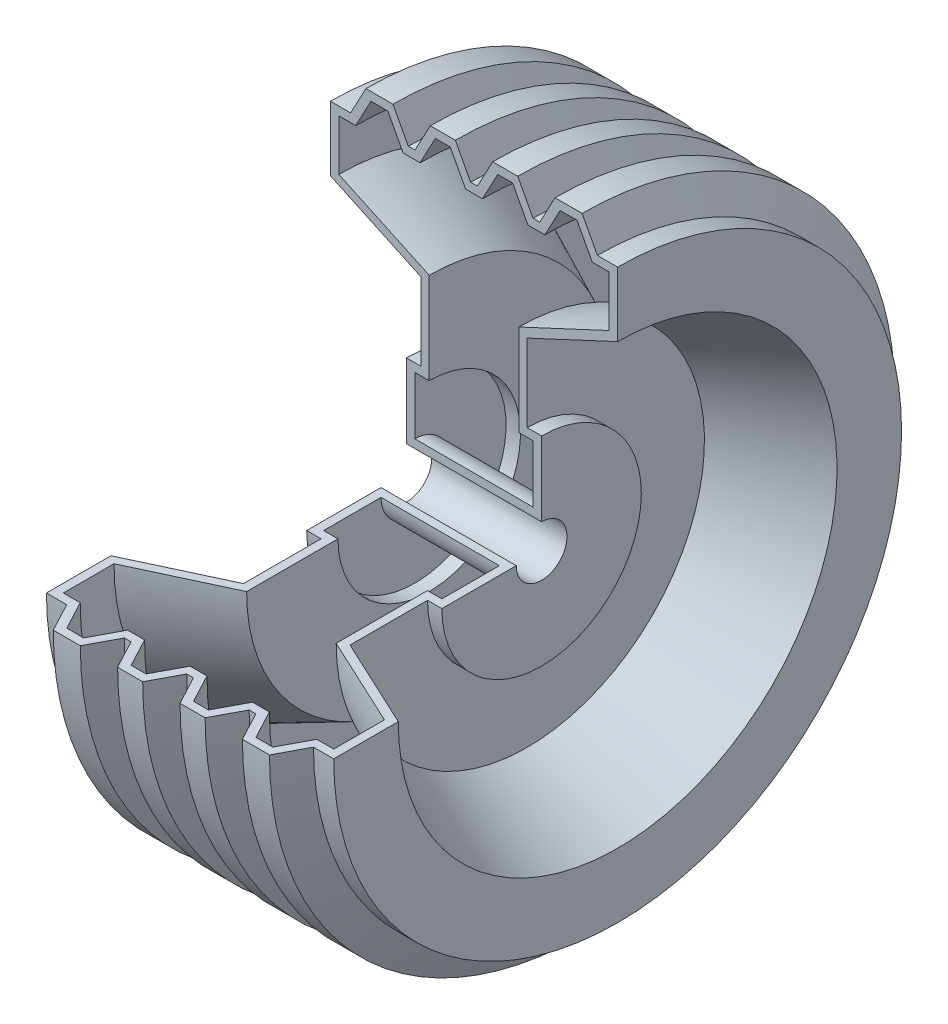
ISO-10303-21;
HEADER;
FILE_DESCRIPTION(('STEP AP214'),'2;1');
FILE_NAME('part.step','',(''),(''),'','','');
FILE_SCHEMA(('AUTOMOTIVE_DESIGN { 1 0 10303 214 1 1 1 1 }'));
ENDSEC;
DATA;
#1=APPLICATION_CONTEXT('core data for automotive mechanical design processes');
#2=APPLICATION_PROTOCOL_DEFINITION('international standard','automotive_design',2000,#1);
#3=PRODUCT_CONTEXT('',#1,'mechanical');
#4=PRODUCT('Part','Part','',(#3));
#5=PRODUCT_RELATED_PRODUCT_CATEGORY('part','',(#4));
#6=PRODUCT_DEFINITION_FORMATION('','',#4);
#7=PRODUCT_DEFINITION_CONTEXT('part definition',#1,'design');
#8=PRODUCT_DEFINITION('design','',#6,#7);
#9=PRODUCT_DEFINITION_SHAPE('','',#8);
#10=(LENGTH_UNIT() NAMED_UNIT(*) SI_UNIT(.MILLI.,.METRE.));
#11=(NAMED_UNIT(*) PLANE_ANGLE_UNIT() SI_UNIT($,.RADIAN.));
#12=(NAMED_UNIT(*) SI_UNIT($,.STERADIAN.) SOLID_ANGLE_UNIT());
#13=UNCERTAINTY_MEASURE_WITH_UNIT(LENGTH_MEASURE(1.E-05),#10,'distance_accuracy_value','');
#14=(GEOMETRIC_REPRESENTATION_CONTEXT(3) GLOBAL_UNCERTAINTY_ASSIGNED_CONTEXT((#13)) GLOBAL_UNIT_ASSIGNED_CONTEXT((#10,
#11,#12)) REPRESENTATION_CONTEXT('',''));
#15=CARTESIAN_POINT('',(0.,0.,0.));
#16=DIRECTION('',(0.,0.,1.));
#17=DIRECTION('',(1.,0.,0.));
#18=AXIS2_PLACEMENT_3D('',#15,#16,#17);
#19=CARTESIAN_POINT('',(-56.6546528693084,0.,0.));
#20=DIRECTION('',(1.,0.,0.));
#21=DIRECTION('',(0.,0.,-1.));
#22=AXIS2_PLACEMENT_3D('',#19,#20,#21);
#23=CYLINDRICAL_SURFACE('',#22,59.);
#24=CARTESIAN_POINT('',(-40.,0.,0.));
#25=DIRECTION('',(1.,0.,0.));
#26=DIRECTION('',(0.,0.,-1.));
#27=AXIS2_PLACEMENT_3D('',#24,#25,#26);
#28=CIRCLE('',#27,59.);
#29=CARTESIAN_POINT('',(-40.,6.17992196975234E-13,59.));
#30=VERTEX_POINT('',#29);
#31=CARTESIAN_POINT('',(-40.,59.,0.));
#32=VERTEX_POINT('',#31);
#33=EDGE_CURVE('E11',#30,#32,#28,.T.);
#34=ORIENTED_EDGE('',*,*,#33,.T.);
#35=DIRECTION('',(-1.,0.,0.));
#36=VECTOR('',#35,1.);
#37=CARTESIAN_POINT('',(-35.,59.,0.));
#38=LINE('',#37,#36);
#39=CARTESIAN_POINT('',(-31.5,59.,0.));
#40=VERTEX_POINT('',#39);
#41=EDGE_CURVE('E396',#40,#32,#38,.T.);
#42=ORIENTED_EDGE('',*,*,#41,.F.);
#43=CARTESIAN_POINT('',(-31.5,0.,0.));
#44=DIRECTION('',(1.,0.,0.));
#45=DIRECTION('',(0.,0.,-1.));
#46=AXIS2_PLACEMENT_3D('',#43,#44,#45);
#47=CIRCLE('',#46,59.);
#48=CARTESIAN_POINT('',(-31.5,6.17992196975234E-13,59.));
#49=VERTEX_POINT('',#48);
#50=EDGE_CURVE('E786',#49,#40,#47,.T.);
#51=ORIENTED_EDGE('',*,*,#50,.F.);
#52=DIRECTION('',(-1.,0.,0.));
#53=VECTOR('',#52,1.);
#54=CARTESIAN_POINT('',(-35.,6.17992196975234E-13,59.));
#55=LINE('',#54,#53);
#56=EDGE_CURVE('E702',#49,#30,#55,.T.);
#57=ORIENTED_EDGE('',*,*,#56,.T.);
#58=EDGE_LOOP('',(#34,#42,#51,#57));
#59=FACE_BOUND('',#58,.T.);
#60=ADVANCED_FACE('F36',(#59),#23,.T.);
#61=CARTESIAN_POINT('',(-40.,2.09488880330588E-13,20.));
#62=DIRECTION('',(-1.,0.,0.));
#63=DIRECTION('',(0.,0.,1.));
#64=AXIS2_PLACEMENT_3D('',#61,#62,#63);
#65=PLANE('',#64);
#66=CARTESIAN_POINT('',(-40.,0.,0.));
#67=DIRECTION('',(1.,0.,0.));
#68=DIRECTION('',(0.,0.,-1.));
#69=AXIS2_PLACEMENT_3D('',#66,#67,#68);
#70=CIRCLE('',#69,15.);
#71=CARTESIAN_POINT('',(-40.,1.57116660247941E-13,15.));
#72=VERTEX_POINT('',#71);
#73=CARTESIAN_POINT('',(-40.,15.,0.));
#74=VERTEX_POINT('',#73);
#75=EDGE_CURVE('E44',#72,#74,#70,.T.);
#76=ORIENTED_EDGE('',*,*,#75,.T.);
#77=DIRECTION('',(0.,-1.,0.));
#78=VECTOR('',#77,1.);
#79=CARTESIAN_POINT('',(-40.,20.,0.));
#80=LINE('',#79,#78);
#81=EDGE_CURVE('E621',#32,#74,#80,.T.);
#82=ORIENTED_EDGE('',*,*,#81,.F.);
#83=ORIENTED_EDGE('',*,*,#33,.F.);
#84=DIRECTION('',(0.,0.,-1.));
#85=VECTOR('',#84,1.);
#86=CARTESIAN_POINT('',(-40.,2.09488880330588E-13,20.));
#87=LINE('',#86,#85);
#88=EDGE_CURVE('E705',#30,#72,#87,.T.);
#89=ORIENTED_EDGE('',*,*,#88,.T.);
#90=EDGE_LOOP('',(#76,#82,#83,#89));
#91=FACE_BOUND('',#90,.T.);
#92=ADVANCED_FACE('F38',(#91),#65,.T.);
#93=CARTESIAN_POINT('',(-56.6546528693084,0.,0.));
#94=DIRECTION('',(1.,0.,0.));
#95=DIRECTION('',(0.,0.,-1.));
#96=AXIS2_PLACEMENT_3D('',#93,#94,#95);
#97=CYLINDRICAL_SURFACE('',#96,15.);
#98=CARTESIAN_POINT('',(40.,0.,0.));
#99=DIRECTION('',(1.,0.,0.));
#100=DIRECTION('',(0.,0.,-1.));
#101=AXIS2_PLACEMENT_3D('',#98,#99,#100);
#102=CIRCLE('',#101,15.);
#103=CARTESIAN_POINT('',(40.,1.57116660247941E-13,15.));
#104=VERTEX_POINT('',#103);
#105=CARTESIAN_POINT('',(40.,15.,0.));
#106=VERTEX_POINT('',#105);
#107=EDGE_CURVE('E836',#104,#106,#102,.T.);
#108=ORIENTED_EDGE('',*,*,#107,.T.);
#109=DIRECTION('',(1.,0.,0.));
#110=VECTOR('',#109,1.);
#111=CARTESIAN_POINT('',(-35.,15.,0.));
#112=LINE('',#111,#110);
#113=EDGE_CURVE('E624',#74,#106,#112,.T.);
#114=ORIENTED_EDGE('',*,*,#113,.F.);
#115=ORIENTED_EDGE('',*,*,#75,.F.);
#116=DIRECTION('',(1.,0.,0.));
#117=VECTOR('',#116,1.);
#118=CARTESIAN_POINT('',(-35.,1.57116660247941E-13,15.));
#119=LINE('',#118,#117);
#120=EDGE_CURVE('E708',#72,#104,#119,.T.);
#121=ORIENTED_EDGE('',*,*,#120,.T.);
#122=EDGE_LOOP('',(#108,#114,#115,#121));
#123=FACE_BOUND('',#122,.T.);
#124=ADVANCED_FACE('F845',(#123),#97,.F.);
#125=CARTESIAN_POINT('',(40.,2.09488880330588E-13,20.));
#126=DIRECTION('',(1.,0.,0.));
#127=DIRECTION('',(0.,0.,-1.));
#128=AXIS2_PLACEMENT_3D('',#125,#126,#127);
#129=PLANE('',#128);
#130=CARTESIAN_POINT('',(40.,0.,0.));
#131=DIRECTION('',(1.,0.,0.));
#132=DIRECTION('',(0.,0.,-1.));
#133=AXIS2_PLACEMENT_3D('',#130,#131,#132);
#134=CIRCLE('',#133,59.);
#135=CARTESIAN_POINT('',(40.,6.17992196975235E-13,59.));
#136=VERTEX_POINT('',#135);
#137=CARTESIAN_POINT('',(40.,59.,0.));
#138=VERTEX_POINT('',#137);
#139=EDGE_CURVE('E834',#136,#138,#134,.T.);
#140=ORIENTED_EDGE('',*,*,#139,.T.);
#141=DIRECTION('',(0.,1.,0.));
#142=VECTOR('',#141,1.);
#143=CARTESIAN_POINT('',(40.,20.,0.));
#144=LINE('',#143,#142);
#145=EDGE_CURVE('E627',#106,#138,#144,.T.);
#146=ORIENTED_EDGE('',*,*,#145,.F.);
#147=ORIENTED_EDGE('',*,*,#107,.F.);
#148=DIRECTION('',(0.,0.,1.));
#149=VECTOR('',#148,1.);
#150=CARTESIAN_POINT('',(40.,2.09488880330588E-13,20.));
#151=LINE('',#150,#149);
#152=EDGE_CURVE('E711',#104,#136,#151,.T.);
#153=ORIENTED_EDGE('',*,*,#152,.T.);
#154=EDGE_LOOP('',(#140,#146,#147,#153));
#155=FACE_BOUND('',#154,.T.);
#156=ADVANCED_FACE('F848',(#155),#129,.T.);
#157=CARTESIAN_POINT('',(-56.6546528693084,0.,0.));
#158=DIRECTION('',(1.,0.,0.));
#159=DIRECTION('',(0.,0.,-1.));
#160=AXIS2_PLACEMENT_3D('',#157,#158,#159);
#161=CYLINDRICAL_SURFACE('',#160,59.);
#162=CARTESIAN_POINT('',(31.5,0.,0.));
#163=DIRECTION('',(1.,0.,0.));
#164=DIRECTION('',(0.,0.,-1.));
#165=AXIS2_PLACEMENT_3D('',#162,#163,#164);
#166=CIRCLE('',#165,59.);
#167=CARTESIAN_POINT('',(31.5,6.17992196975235E-13,59.));
#168=VERTEX_POINT('',#167);
#169=CARTESIAN_POINT('',(31.5,59.,0.));
#170=VERTEX_POINT('',#169);
#171=EDGE_CURVE('E832',#168,#170,#166,.T.);
#172=ORIENTED_EDGE('',*,*,#171,.T.);
#173=DIRECTION('',(-1.,0.,0.));
#174=VECTOR('',#173,1.);
#175=CARTESIAN_POINT('',(35.,59.,0.));
#176=LINE('',#175,#174);
#177=EDGE_CURVE('E630',#138,#170,#176,.T.);
#178=ORIENTED_EDGE('',*,*,#177,.F.);
#179=ORIENTED_EDGE('',*,*,#139,.F.);
#180=DIRECTION('',(-1.,0.,0.));
#181=VECTOR('',#180,1.);
#182=CARTESIAN_POINT('',(35.,6.17992196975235E-13,59.));
#183=LINE('',#182,#181);
#184=EDGE_CURVE('E714',#136,#168,#183,.T.);
#185=ORIENTED_EDGE('',*,*,#184,.T.);
#186=EDGE_LOOP('',(#172,#178,#179,#185));
#187=FACE_BOUND('',#186,.T.);
#188=ADVANCED_FACE('F853',(#187),#161,.T.);
#189=CARTESIAN_POINT('',(31.5,5.65619976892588E-13,54.));
#190=DIRECTION('',(1.,0.,0.));
#191=DIRECTION('',(0.,0.,-1.));
#192=AXIS2_PLACEMENT_3D('',#189,#190,#191);
#193=PLANE('',#192);
#194=CARTESIAN_POINT('',(31.5,0.,0.));
#195=DIRECTION('',(1.,0.,0.));
#196=DIRECTION('',(0.,0.,-1.));
#197=AXIS2_PLACEMENT_3D('',#194,#195,#196);
#198=CIRCLE('',#197,104.86718898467);
#199=CARTESIAN_POINT('',(31.5,1.09842550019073E-12,104.86718898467));
#200=VERTEX_POINT('',#199);
#201=CARTESIAN_POINT('',(31.5,104.86718898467,0.));
#202=VERTEX_POINT('',#201);
#203=EDGE_CURVE('E830',#200,#202,#198,.T.);
#204=ORIENTED_EDGE('',*,*,#203,.T.);
#205=DIRECTION('',(0.,1.,0.));
#206=VECTOR('',#205,1.);
#207=CARTESIAN_POINT('',(31.5,54.,0.));
#208=LINE('',#207,#206);
#209=EDGE_CURVE('E633',#170,#202,#208,.T.);
#210=ORIENTED_EDGE('',*,*,#209,.F.);
#211=ORIENTED_EDGE('',*,*,#171,.F.);
#212=DIRECTION('',(0.,0.,1.));
#213=VECTOR('',#212,1.);
#214=CARTESIAN_POINT('',(31.5,5.65619976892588E-13,54.));
#215=LINE('',#214,#213);
#216=EDGE_CURVE('E717',#168,#200,#215,.T.);
#217=ORIENTED_EDGE('',*,*,#216,.T.);
#218=EDGE_LOOP('',(#204,#210,#211,#217));
#219=FACE_BOUND('',#218,.T.);
#220=ADVANCED_FACE('F856',(#219),#193,.T.);
#221=CARTESIAN_POINT('',(31.5,0.,0.));
#222=DIRECTION('',(1.,0.,0.));
#223=DIRECTION('',(0.,0.,-1.));
#224=AXIS2_PLACEMENT_3D('',#221,#222,#223);
#225=CONICAL_SURFACE('',#224,104.86718898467,0.436332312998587);
#226=CARTESIAN_POINT('',(85.,0.,0.));
#227=DIRECTION('',(1.,0.,0.));
#228=DIRECTION('',(0.,0.,-1.));
#229=AXIS2_PLACEMENT_3D('',#226,#227,#228);
#230=CIRCLE('',#229,129.814648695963);
#231=CARTESIAN_POINT('',(85.,1.35973627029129E-12,129.814648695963));
#232=VERTEX_POINT('',#231);
#233=CARTESIAN_POINT('',(85.,129.814648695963,0.));
#234=VERTEX_POINT('',#233);
#235=EDGE_CURVE('E828',#232,#234,#230,.T.);
#236=ORIENTED_EDGE('',*,*,#235,.T.);
#237=DIRECTION('',(0.906307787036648,0.422618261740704,0.));
#238=VECTOR('',#237,1.);
#239=CARTESIAN_POINT('',(28.6130913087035,103.521001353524,0.));
#240=LINE('',#239,#238);
#241=EDGE_CURVE('E636',#202,#234,#240,.T.);
#242=ORIENTED_EDGE('',*,*,#241,.F.);
#243=ORIENTED_EDGE('',*,*,#203,.F.);
#244=DIRECTION('',(0.906307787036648,0.,0.422618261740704));
#245=VECTOR('',#244,1.);
#246=CARTESIAN_POINT('',(28.6130913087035,1.08432493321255E-12,103.521001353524));
#247=LINE('',#246,#245);
#248=EDGE_CURVE('E720',#200,#232,#247,.T.);
#249=ORIENTED_EDGE('',*,*,#248,.T.);
#250=EDGE_LOOP('',(#236,#242,#243,#249));
#251=FACE_BOUND('',#250,.T.);
#252=ADVANCED_FACE('F861',(#251),#225,.F.);
#253=CARTESIAN_POINT('',(85.,1.39310105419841E-12,133.));
#254=DIRECTION('',(1.,0.,0.));
#255=DIRECTION('',(0.,0.,-1.));
#256=AXIS2_PLACEMENT_3D('',#253,#254,#255);
#257=PLANE('',#256);
#258=CARTESIAN_POINT('',(85.,0.,0.));
#259=DIRECTION('',(1.,0.,0.));
#260=DIRECTION('',(0.,0.,-1.));
#261=AXIS2_PLACEMENT_3D('',#258,#259,#260);
#262=CIRCLE('',#261,168.);
#263=CARTESIAN_POINT('',(85.,1.75970659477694E-12,168.));
#264=VERTEX_POINT('',#263);
#265=CARTESIAN_POINT('',(85.,168.,0.));
#266=VERTEX_POINT('',#265);
#267=EDGE_CURVE('E826',#264,#266,#262,.T.);
#268=ORIENTED_EDGE('',*,*,#267,.T.);
#269=DIRECTION('',(0.,1.,0.));
#270=VECTOR('',#269,1.);
#271=CARTESIAN_POINT('',(85.,133.,0.));
#272=LINE('',#271,#270);
#273=EDGE_CURVE('E639',#234,#266,#272,.T.);
#274=ORIENTED_EDGE('',*,*,#273,.F.);
#275=ORIENTED_EDGE('',*,*,#235,.F.);
#276=DIRECTION('',(0.,0.,1.));
#277=VECTOR('',#276,1.);
#278=CARTESIAN_POINT('',(85.,1.39310105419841E-12,133.));
#279=LINE('',#278,#277);
#280=EDGE_CURVE('E723',#232,#264,#279,.T.);
#281=ORIENTED_EDGE('',*,*,#280,.T.);
#282=EDGE_LOOP('',(#268,#274,#275,#281));
#283=FACE_BOUND('',#282,.T.);
#284=ADVANCED_FACE('F864',(#283),#257,.T.);
#285=CARTESIAN_POINT('',(-56.6546528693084,0.,0.));
#286=DIRECTION('',(1.,0.,0.));
#287=DIRECTION('',(0.,0.,-1.));
#288=AXIS2_PLACEMENT_3D('',#285,#286,#287);
#289=CYLINDRICAL_SURFACE('',#288,168.);
#290=CARTESIAN_POINT('',(73.0043030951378,0.,0.));
#291=DIRECTION('',(1.,0.,0.));
#292=DIRECTION('',(0.,0.,-1.));
#293=AXIS2_PLACEMENT_3D('',#290,#291,#292);
#294=CIRCLE('',#293,168.);
#295=CARTESIAN_POINT('',(73.0043030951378,1.75970659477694E-12,168.));
#296=VERTEX_POINT('',#295);
#297=CARTESIAN_POINT('',(73.0043030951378,168.,0.));
#298=VERTEX_POINT('',#297);
#299=EDGE_CURVE('E824',#296,#298,#294,.T.);
#300=ORIENTED_EDGE('',*,*,#299,.T.);
#301=DIRECTION('',(-1.,0.,0.));
#302=VECTOR('',#301,1.);
#303=CARTESIAN_POINT('',(80.,168.,0.));
#304=LINE('',#303,#302);
#305=EDGE_CURVE('E642',#266,#298,#304,.T.);
#306=ORIENTED_EDGE('',*,*,#305,.F.);
#307=ORIENTED_EDGE('',*,*,#267,.F.);
#308=DIRECTION('',(-1.,0.,0.));
#309=VECTOR('',#308,1.);
#310=CARTESIAN_POINT('',(80.,1.75970659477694E-12,168.));
#311=LINE('',#310,#309);
#312=EDGE_CURVE('E726',#264,#296,#311,.T.);
#313=ORIENTED_EDGE('',*,*,#312,.T.);
#314=EDGE_LOOP('',(#300,#306,#307,#313));
#315=FACE_BOUND('',#314,.T.);
#316=ADVANCED_FACE('F869',(#315),#289,.T.);
#317=CARTESIAN_POINT('',(73.0043030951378,0.,0.));
#318=DIRECTION('',(-1.,0.,0.));
#319=DIRECTION('',(0.,0.,1.));
#320=AXIS2_PLACEMENT_3D('',#317,#318,#319);
#321=CONICAL_SURFACE('',#320,168.,1.08210413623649);
#322=CARTESIAN_POINT('',(63.9652427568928,0.,0.));
#323=DIRECTION('',(1.,0.,0.));
#324=DIRECTION('',(0.,0.,-1.));
#325=AXIS2_PLACEMENT_3D('',#322,#323,#324);
#326=CIRCLE('',#325,185.);
#327=CARTESIAN_POINT('',(63.9652427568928,1.93777214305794E-12,185.));
#328=VERTEX_POINT('',#327);
#329=CARTESIAN_POINT('',(63.9652427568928,185.,0.));
#330=VERTEX_POINT('',#329);
#331=EDGE_CURVE('E822',#328,#330,#326,.T.);
#332=ORIENTED_EDGE('',*,*,#331,.T.);
#333=DIRECTION('',(-0.469471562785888,0.882947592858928,0.));
#334=VECTOR('',#333,1.);
#335=CARTESIAN_POINT('',(74.4147379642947,165.347357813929,0.));
#336=LINE('',#335,#334);
#337=EDGE_CURVE('E645',#298,#330,#336,.T.);
#338=ORIENTED_EDGE('',*,*,#337,.F.);
#339=ORIENTED_EDGE('',*,*,#299,.F.);
#340=DIRECTION('',(-0.469471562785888,0.,0.882947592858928));
#341=VECTOR('',#340,1.);
#342=CARTESIAN_POINT('',(74.4147379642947,1.73192164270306E-12,165.347357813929));
#343=LINE('',#342,#341);
#344=EDGE_CURVE('E729',#296,#328,#343,.T.);
#345=ORIENTED_EDGE('',*,*,#344,.T.);
#346=EDGE_LOOP('',(#332,#338,#339,#345));
#347=FACE_BOUND('',#346,.T.);
#348=ADVANCED_FACE('F872',(#347),#321,.T.);
#349=CARTESIAN_POINT('',(-56.6546528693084,0.,0.));
#350=DIRECTION('',(1.,0.,0.));
#351=DIRECTION('',(0.,0.,-1.));
#352=AXIS2_PLACEMENT_3D('',#349,#350,#351);
#353=CYLINDRICAL_SURFACE('',#352,185.);
#354=CARTESIAN_POINT('',(47.956636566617,0.,0.));
#355=DIRECTION('',(1.,0.,0.));
#356=DIRECTION('',(0.,0.,-1.));
#357=AXIS2_PLACEMENT_3D('',#354,#355,#356);
#358=CIRCLE('',#357,185.);
#359=CARTESIAN_POINT('',(47.956636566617,1.93777214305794E-12,185.));
#360=VERTEX_POINT('',#359);
#361=CARTESIAN_POINT('',(47.956636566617,185.,0.));
#362=VERTEX_POINT('',#361);
#363=EDGE_CURVE('E820',#360,#362,#358,.T.);
#364=ORIENTED_EDGE('',*,*,#363,.T.);
#365=DIRECTION('',(-1.,0.,0.));
#366=VECTOR('',#365,1.);
#367=CARTESIAN_POINT('',(60.9609396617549,185.,0.));
#368=LINE('',#367,#366);
#369=EDGE_CURVE('E648',#330,#362,#368,.T.);
#370=ORIENTED_EDGE('',*,*,#369,.F.);
#371=ORIENTED_EDGE('',*,*,#331,.F.);
#372=DIRECTION('',(-1.,0.,0.));
#373=VECTOR('',#372,1.);
#374=CARTESIAN_POINT('',(60.9609396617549,1.93777214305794E-12,185.));
#375=LINE('',#374,#373);
#376=EDGE_CURVE('E732',#328,#360,#375,.T.);
#377=ORIENTED_EDGE('',*,*,#376,.T.);
#378=EDGE_LOOP('',(#364,#370,#371,#377));
#379=FACE_BOUND('',#378,.T.);
#380=ADVANCED_FACE('F877',(#379),#353,.T.);
#381=CARTESIAN_POINT('',(47.956636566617,0.,0.));
#382=DIRECTION('',(1.,0.,0.));
#383=DIRECTION('',(0.,0.,-1.));
#384=AXIS2_PLACEMENT_3D('',#381,#382,#383);
#385=CONICAL_SURFACE('',#384,185.,1.08210413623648);
#386=CARTESIAN_POINT('',(38.9175762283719,0.,0.));
#387=DIRECTION('',(1.,0.,0.));
#388=DIRECTION('',(0.,0.,-1.));
#389=AXIS2_PLACEMENT_3D('',#386,#387,#388);
#390=CIRCLE('',#389,168.);
#391=CARTESIAN_POINT('',(38.9175762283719,1.75970659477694E-12,168.));
#392=VERTEX_POINT('',#391);
#393=CARTESIAN_POINT('',(38.9175762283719,168.,0.));
#394=VERTEX_POINT('',#393);
#395=EDGE_CURVE('E818',#392,#394,#390,.T.);
#396=ORIENTED_EDGE('',*,*,#395,.T.);
#397=DIRECTION('',(-0.469471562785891,-0.882947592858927,0.));
#398=VECTOR('',#397,1.);
#399=CARTESIAN_POINT('',(46.5462016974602,182.347357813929,0.));
#400=LINE('',#399,#398);
#401=EDGE_CURVE('E651',#362,#394,#400,.T.);
#402=ORIENTED_EDGE('',*,*,#401,.F.);
#403=ORIENTED_EDGE('',*,*,#363,.F.);
#404=DIRECTION('',(-0.469471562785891,0.,-0.882947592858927));
#405=VECTOR('',#404,1.);
#406=CARTESIAN_POINT('',(46.5462016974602,1.90998719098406E-12,182.347357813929));
#407=LINE('',#406,#405);
#408=EDGE_CURVE('E735',#360,#392,#407,.T.);
#409=ORIENTED_EDGE('',*,*,#408,.T.);
#410=EDGE_LOOP('',(#396,#402,#403,#409));
#411=FACE_BOUND('',#410,.T.);
#412=ADVANCED_FACE('F880',(#411),#385,.T.);
#413=CARTESIAN_POINT('',(-56.6546528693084,0.,0.));
#414=DIRECTION('',(1.,0.,0.));
#415=DIRECTION('',(0.,0.,-1.));
#416=AXIS2_PLACEMENT_3D('',#413,#414,#415);
#417=CYLINDRICAL_SURFACE('',#416,168.);
#418=CARTESIAN_POINT('',(34.9261824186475,0.,0.));
#419=DIRECTION('',(1.,0.,0.));
#420=DIRECTION('',(0.,0.,-1.));
#421=AXIS2_PLACEMENT_3D('',#418,#419,#420);
#422=CIRCLE('',#421,168.);
#423=CARTESIAN_POINT('',(34.9261824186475,1.75970659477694E-12,168.));
#424=VERTEX_POINT('',#423);
#425=CARTESIAN_POINT('',(34.9261824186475,168.,0.));
#426=VERTEX_POINT('',#425);
#427=EDGE_CURVE('E816',#424,#426,#422,.T.);
#428=ORIENTED_EDGE('',*,*,#427,.T.);
#429=DIRECTION('',(-1.,0.,0.));
#430=VECTOR('',#429,1.);
#431=CARTESIAN_POINT('',(41.9218793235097,168.,0.));
#432=LINE('',#431,#430);
#433=EDGE_CURVE('E654',#394,#426,#432,.T.);
#434=ORIENTED_EDGE('',*,*,#433,.F.);
#435=ORIENTED_EDGE('',*,*,#395,.F.);
#436=DIRECTION('',(-1.,0.,0.));
#437=VECTOR('',#436,1.);
#438=CARTESIAN_POINT('',(41.9218793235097,1.75970659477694E-12,168.));
#439=LINE('',#438,#437);
#440=EDGE_CURVE('E738',#392,#424,#439,.T.);
#441=ORIENTED_EDGE('',*,*,#440,.T.);
#442=EDGE_LOOP('',(#428,#434,#435,#441));
#443=FACE_BOUND('',#442,.T.);
#444=ADVANCED_FACE('F885',(#443),#417,.T.);
#445=CARTESIAN_POINT('',(34.9261824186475,0.,0.));
#446=DIRECTION('',(-1.,0.,0.));
#447=DIRECTION('',(0.,0.,1.));
#448=AXIS2_PLACEMENT_3D('',#445,#446,#447);
#449=CONICAL_SURFACE('',#448,168.,1.08210413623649);
#450=CARTESIAN_POINT('',(25.8871220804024,0.,0.));
#451=DIRECTION('',(1.,0.,0.));
#452=DIRECTION('',(0.,0.,-1.));
#453=AXIS2_PLACEMENT_3D('',#450,#451,#452);
#454=CIRCLE('',#453,185.);
#455=CARTESIAN_POINT('',(25.8871220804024,1.93777214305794E-12,185.));
#456=VERTEX_POINT('',#455);
#457=CARTESIAN_POINT('',(25.8871220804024,185.,0.));
#458=VERTEX_POINT('',#457);
#459=EDGE_CURVE('E814',#456,#458,#454,.T.);
#460=ORIENTED_EDGE('',*,*,#459,.T.);
#461=DIRECTION('',(-0.46947156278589,0.882947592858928,0.));
#462=VECTOR('',#461,1.);
#463=CARTESIAN_POINT('',(36.3366172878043,165.347357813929,0.));
#464=LINE('',#463,#462);
#465=EDGE_CURVE('E657',#426,#458,#464,.T.);
#466=ORIENTED_EDGE('',*,*,#465,.F.);
#467=ORIENTED_EDGE('',*,*,#427,.F.);
#468=DIRECTION('',(-0.46947156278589,0.,0.882947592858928));
#469=VECTOR('',#468,1.);
#470=CARTESIAN_POINT('',(36.3366172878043,1.73192164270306E-12,165.347357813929));
#471=LINE('',#470,#469);
#472=EDGE_CURVE('E741',#424,#456,#471,.T.);
#473=ORIENTED_EDGE('',*,*,#472,.T.);
#474=EDGE_LOOP('',(#460,#466,#467,#473));
#475=FACE_BOUND('',#474,.T.);
#476=ADVANCED_FACE('F888',(#475),#449,.T.);
#477=CARTESIAN_POINT('',(-56.6546528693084,0.,0.));
#478=DIRECTION('',(1.,0.,0.));
#479=DIRECTION('',(0.,0.,-1.));
#480=AXIS2_PLACEMENT_3D('',#477,#478,#479);
#481=CYLINDRICAL_SURFACE('',#480,185.);
#482=CARTESIAN_POINT('',(11.0347572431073,0.,0.));
#483=DIRECTION('',(1.,0.,0.));
#484=DIRECTION('',(0.,0.,-1.));
#485=AXIS2_PLACEMENT_3D('',#482,#483,#484);
#486=CIRCLE('',#485,185.);
#487=CARTESIAN_POINT('',(11.0347572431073,1.93777214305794E-12,185.));
#488=VERTEX_POINT('',#487);
#489=CARTESIAN_POINT('',(11.0347572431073,185.,0.));
#490=VERTEX_POINT('',#489);
#491=EDGE_CURVE('E812',#488,#490,#486,.T.);
#492=ORIENTED_EDGE('',*,*,#491,.T.);
#493=DIRECTION('',(-1.,0.,0.));
#494=VECTOR('',#493,1.);
#495=CARTESIAN_POINT('',(22.8828189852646,185.,0.));
#496=LINE('',#495,#494);
#497=EDGE_CURVE('E660',#458,#490,#496,.T.);
#498=ORIENTED_EDGE('',*,*,#497,.F.);
#499=ORIENTED_EDGE('',*,*,#459,.F.);
#500=DIRECTION('',(-1.,0.,0.));
#501=VECTOR('',#500,1.);
#502=CARTESIAN_POINT('',(22.8828189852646,1.93777214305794E-12,185.));
#503=LINE('',#502,#501);
#504=EDGE_CURVE('E744',#456,#488,#503,.T.);
#505=ORIENTED_EDGE('',*,*,#504,.T.);
#506=EDGE_LOOP('',(#492,#498,#499,#505));
#507=FACE_BOUND('',#506,.T.);
#508=ADVANCED_FACE('F893',(#507),#481,.T.);
#509=CARTESIAN_POINT('',(11.0347572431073,0.,0.));
#510=DIRECTION('',(1.,0.,0.));
#511=DIRECTION('',(0.,0.,-1.));
#512=AXIS2_PLACEMENT_3D('',#509,#510,#511);
#513=CONICAL_SURFACE('',#512,185.,1.08210413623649);
#514=CARTESIAN_POINT('',(1.99569690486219,0.,0.));
#515=DIRECTION('',(1.,0.,0.));
#516=DIRECTION('',(0.,0.,-1.));
#517=AXIS2_PLACEMENT_3D('',#514,#515,#516);
#518=CIRCLE('',#517,168.);
#519=CARTESIAN_POINT('',(1.99569690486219,1.75970659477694E-12,168.));
#520=VERTEX_POINT('',#519);
#521=CARTESIAN_POINT('',(1.99569690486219,168.,0.));
#522=VERTEX_POINT('',#521);
#523=EDGE_CURVE('E810',#520,#522,#518,.T.);
#524=ORIENTED_EDGE('',*,*,#523,.T.);
#525=DIRECTION('',(-0.469471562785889,-0.882947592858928,0.));
#526=VECTOR('',#525,1.);
#527=CARTESIAN_POINT('',(9.62432237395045,182.347357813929,0.));
#528=LINE('',#527,#526);
#529=EDGE_CURVE('E663',#490,#522,#528,.T.);
#530=ORIENTED_EDGE('',*,*,#529,.F.);
#531=ORIENTED_EDGE('',*,*,#491,.F.);
#532=DIRECTION('',(-0.469471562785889,0.,-0.882947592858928));
#533=VECTOR('',#532,1.);
#534=CARTESIAN_POINT('',(9.62432237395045,1.90998719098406E-12,182.347357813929));
#535=LINE('',#534,#533);
#536=EDGE_CURVE('E747',#488,#520,#535,.T.);
#537=ORIENTED_EDGE('',*,*,#536,.T.);
#538=EDGE_LOOP('',(#524,#530,#531,#537));
#539=FACE_BOUND('',#538,.T.);
#540=ADVANCED_FACE('F896',(#539),#513,.T.);
#541=CARTESIAN_POINT('',(-56.6546528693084,0.,0.));
#542=DIRECTION('',(1.,0.,0.));
#543=DIRECTION('',(0.,0.,-1.));
#544=AXIS2_PLACEMENT_3D('',#541,#542,#543);
#545=CYLINDRICAL_SURFACE('',#544,168.);
#546=CARTESIAN_POINT('',(-1.99569690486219,0.,0.));
#547=DIRECTION('',(1.,0.,0.));
#548=DIRECTION('',(0.,0.,-1.));
#549=AXIS2_PLACEMENT_3D('',#546,#547,#548);
#550=CIRCLE('',#549,168.);
#551=CARTESIAN_POINT('',(-1.99569690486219,1.75970659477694E-12,168.));
#552=VERTEX_POINT('',#551);
#553=CARTESIAN_POINT('',(-1.99569690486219,168.,0.));
#554=VERTEX_POINT('',#553);
#555=EDGE_CURVE('E808',#552,#554,#550,.T.);
#556=ORIENTED_EDGE('',*,*,#555,.T.);
#557=DIRECTION('',(-1.,0.,0.));
#558=VECTOR('',#557,1.);
#559=CARTESIAN_POINT('',(5.,168.,0.));
#560=LINE('',#559,#558);
#561=EDGE_CURVE('E666',#522,#554,#560,.T.);
#562=ORIENTED_EDGE('',*,*,#561,.F.);
#563=ORIENTED_EDGE('',*,*,#523,.F.);
#564=DIRECTION('',(-1.,0.,0.));
#565=VECTOR('',#564,1.);
#566=CARTESIAN_POINT('',(5.,1.75970659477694E-12,168.));
#567=LINE('',#566,#565);
#568=EDGE_CURVE('E750',#520,#552,#567,.T.);
#569=ORIENTED_EDGE('',*,*,#568,.T.);
#570=EDGE_LOOP('',(#556,#562,#563,#569));
#571=FACE_BOUND('',#570,.T.);
#572=ADVANCED_FACE('F901',(#571),#545,.T.);
#573=CARTESIAN_POINT('',(-1.99569690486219,0.,0.));
#574=DIRECTION('',(-1.,0.,0.));
#575=DIRECTION('',(0.,0.,1.));
#576=AXIS2_PLACEMENT_3D('',#573,#574,#575);
#577=CONICAL_SURFACE('',#576,168.,1.08210413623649);
#578=CARTESIAN_POINT('',(-11.0347572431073,0.,0.));
#579=DIRECTION('',(1.,0.,0.));
#580=DIRECTION('',(0.,0.,-1.));
#581=AXIS2_PLACEMENT_3D('',#578,#579,#580);
#582=CIRCLE('',#581,185.);
#583=CARTESIAN_POINT('',(-11.0347572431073,1.93777214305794E-12,185.));
#584=VERTEX_POINT('',#583);
#585=CARTESIAN_POINT('',(-11.0347572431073,185.,0.));
#586=VERTEX_POINT('',#585);
#587=EDGE_CURVE('E806',#584,#586,#582,.T.);
#588=ORIENTED_EDGE('',*,*,#587,.T.);
#589=DIRECTION('',(-0.469471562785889,0.882947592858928,0.));
#590=VECTOR('',#589,1.);
#591=CARTESIAN_POINT('',(-9.62432237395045,182.347357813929,0.));
#592=LINE('',#591,#590);
#593=EDGE_CURVE('E669',#554,#586,#592,.T.);
#594=ORIENTED_EDGE('',*,*,#593,.F.);
#595=ORIENTED_EDGE('',*,*,#555,.F.);
#596=DIRECTION('',(-0.469471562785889,0.,0.882947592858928));
#597=VECTOR('',#596,1.);
#598=CARTESIAN_POINT('',(-9.62432237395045,1.90998719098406E-12,182.347357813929));
#599=LINE('',#598,#597);
#600=EDGE_CURVE('E753',#552,#584,#599,.T.);
#601=ORIENTED_EDGE('',*,*,#600,.T.);
#602=EDGE_LOOP('',(#588,#594,#595,#601));
#603=FACE_BOUND('',#602,.T.);
#604=ADVANCED_FACE('F904',(#603),#577,.T.);
#605=CARTESIAN_POINT('',(-56.6546528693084,0.,0.));
#606=DIRECTION('',(1.,0.,0.));
#607=DIRECTION('',(0.,0.,-1.));
#608=AXIS2_PLACEMENT_3D('',#605,#606,#607);
#609=CYLINDRICAL_SURFACE('',#608,185.);
#610=CARTESIAN_POINT('',(-25.8871220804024,0.,0.));
#611=DIRECTION('',(1.,0.,0.));
#612=DIRECTION('',(0.,0.,-1.));
#613=AXIS2_PLACEMENT_3D('',#610,#611,#612);
#614=CIRCLE('',#613,185.);
#615=CARTESIAN_POINT('',(-25.8871220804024,1.93777214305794E-12,185.));
#616=VERTEX_POINT('',#615);
#617=CARTESIAN_POINT('',(-25.8871220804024,185.,0.));
#618=VERTEX_POINT('',#617);
#619=EDGE_CURVE('E804',#616,#618,#614,.T.);
#620=ORIENTED_EDGE('',*,*,#619,.T.);
#621=DIRECTION('',(-1.,0.,0.));
#622=VECTOR('',#621,1.);
#623=CARTESIAN_POINT('',(-22.8828189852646,185.,0.));
#624=LINE('',#623,#622);
#625=EDGE_CURVE('E672',#586,#618,#624,.T.);
#626=ORIENTED_EDGE('',*,*,#625,.F.);
#627=ORIENTED_EDGE('',*,*,#587,.F.);
#628=DIRECTION('',(-1.,0.,0.));
#629=VECTOR('',#628,1.);
#630=CARTESIAN_POINT('',(-22.8828189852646,1.93777214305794E-12,185.));
#631=LINE('',#630,#629);
#632=EDGE_CURVE('E756',#584,#616,#631,.T.);
#633=ORIENTED_EDGE('',*,*,#632,.T.);
#634=EDGE_LOOP('',(#620,#626,#627,#633));
#635=FACE_BOUND('',#634,.T.);
#636=ADVANCED_FACE('F909',(#635),#609,.T.);
#637=CARTESIAN_POINT('',(-25.8871220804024,0.,0.));
#638=DIRECTION('',(1.,0.,0.));
#639=DIRECTION('',(0.,0.,-1.));
#640=AXIS2_PLACEMENT_3D('',#637,#638,#639);
#641=CONICAL_SURFACE('',#640,185.,1.08210413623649);
#642=CARTESIAN_POINT('',(-34.9261824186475,0.,0.));
#643=DIRECTION('',(1.,0.,0.));
#644=DIRECTION('',(0.,0.,-1.));
#645=AXIS2_PLACEMENT_3D('',#642,#643,#644);
#646=CIRCLE('',#645,168.);
#647=CARTESIAN_POINT('',(-34.9261824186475,1.75970659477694E-12,168.));
#648=VERTEX_POINT('',#647);
#649=CARTESIAN_POINT('',(-34.9261824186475,168.,0.));
#650=VERTEX_POINT('',#649);
#651=EDGE_CURVE('E802',#648,#650,#646,.T.);
#652=ORIENTED_EDGE('',*,*,#651,.T.);
#653=DIRECTION('',(-0.46947156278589,-0.882947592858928,0.));
#654=VECTOR('',#653,1.);
#655=CARTESIAN_POINT('',(-36.3366172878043,165.347357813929,0.));
#656=LINE('',#655,#654);
#657=EDGE_CURVE('E675',#618,#650,#656,.T.);
#658=ORIENTED_EDGE('',*,*,#657,.F.);
#659=ORIENTED_EDGE('',*,*,#619,.F.);
#660=DIRECTION('',(-0.46947156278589,0.,-0.882947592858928));
#661=VECTOR('',#660,1.);
#662=CARTESIAN_POINT('',(-36.3366172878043,1.73192164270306E-12,165.347357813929));
#663=LINE('',#662,#661);
#664=EDGE_CURVE('E759',#616,#648,#663,.T.);
#665=ORIENTED_EDGE('',*,*,#664,.T.);
#666=EDGE_LOOP('',(#652,#658,#659,#665));
#667=FACE_BOUND('',#666,.T.);
#668=ADVANCED_FACE('F912',(#667),#641,.T.);
#669=CARTESIAN_POINT('',(-56.6546528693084,0.,0.));
#670=DIRECTION('',(1.,0.,0.));
#671=DIRECTION('',(0.,0.,-1.));
#672=AXIS2_PLACEMENT_3D('',#669,#670,#671);
#673=CYLINDRICAL_SURFACE('',#672,168.);
#674=CARTESIAN_POINT('',(-38.9175762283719,0.,0.));
#675=DIRECTION('',(1.,0.,0.));
#676=DIRECTION('',(0.,0.,-1.));
#677=AXIS2_PLACEMENT_3D('',#674,#675,#676);
#678=CIRCLE('',#677,168.);
#679=CARTESIAN_POINT('',(-38.9175762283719,1.75970659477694E-12,168.));
#680=VERTEX_POINT('',#679);
#681=CARTESIAN_POINT('',(-38.9175762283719,168.,0.));
#682=VERTEX_POINT('',#681);
#683=EDGE_CURVE('E800',#680,#682,#678,.T.);
#684=ORIENTED_EDGE('',*,*,#683,.T.);
#685=DIRECTION('',(-1.,0.,0.));
#686=VECTOR('',#685,1.);
#687=CARTESIAN_POINT('',(-41.9218793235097,168.,0.));
#688=LINE('',#687,#686);
#689=EDGE_CURVE('E678',#650,#682,#688,.T.);
#690=ORIENTED_EDGE('',*,*,#689,.F.);
#691=ORIENTED_EDGE('',*,*,#651,.F.);
#692=DIRECTION('',(-1.,0.,0.));
#693=VECTOR('',#692,1.);
#694=CARTESIAN_POINT('',(-41.9218793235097,1.75970659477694E-12,168.));
#695=LINE('',#694,#693);
#696=EDGE_CURVE('E762',#648,#680,#695,.T.);
#697=ORIENTED_EDGE('',*,*,#696,.T.);
#698=EDGE_LOOP('',(#684,#690,#691,#697));
#699=FACE_BOUND('',#698,.T.);
#700=ADVANCED_FACE('F917',(#699),#673,.T.);
#701=CARTESIAN_POINT('',(-38.9175762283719,0.,0.));
#702=DIRECTION('',(-1.,0.,0.));
#703=DIRECTION('',(0.,0.,1.));
#704=AXIS2_PLACEMENT_3D('',#701,#702,#703);
#705=CONICAL_SURFACE('',#704,168.,1.08210413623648);
#706=CARTESIAN_POINT('',(-47.956636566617,0.,0.));
#707=DIRECTION('',(1.,0.,0.));
#708=DIRECTION('',(0.,0.,-1.));
#709=AXIS2_PLACEMENT_3D('',#706,#707,#708);
#710=CIRCLE('',#709,185.);
#711=CARTESIAN_POINT('',(-47.956636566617,1.93777214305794E-12,185.));
#712=VERTEX_POINT('',#711);
#713=CARTESIAN_POINT('',(-47.956636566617,185.,0.));
#714=VERTEX_POINT('',#713);
#715=EDGE_CURVE('E798',#712,#714,#710,.T.);
#716=ORIENTED_EDGE('',*,*,#715,.T.);
#717=DIRECTION('',(-0.469471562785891,0.882947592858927,0.));
#718=VECTOR('',#717,1.);
#719=CARTESIAN_POINT('',(-46.5462016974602,182.347357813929,0.));
#720=LINE('',#719,#718);
#721=EDGE_CURVE('E681',#682,#714,#720,.T.);
#722=ORIENTED_EDGE('',*,*,#721,.F.);
#723=ORIENTED_EDGE('',*,*,#683,.F.);
#724=DIRECTION('',(-0.469471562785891,0.,0.882947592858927));
#725=VECTOR('',#724,1.);
#726=CARTESIAN_POINT('',(-46.5462016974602,1.90998719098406E-12,182.347357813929));
#727=LINE('',#726,#725);
#728=EDGE_CURVE('E765',#680,#712,#727,.T.);
#729=ORIENTED_EDGE('',*,*,#728,.T.);
#730=EDGE_LOOP('',(#716,#722,#723,#729));
#731=FACE_BOUND('',#730,.T.);
#732=ADVANCED_FACE('F920',(#731),#705,.T.);
#733=CARTESIAN_POINT('',(-56.6546528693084,0.,0.));
#734=DIRECTION('',(1.,0.,0.));
#735=DIRECTION('',(0.,0.,-1.));
#736=AXIS2_PLACEMENT_3D('',#733,#734,#735);
#737=CYLINDRICAL_SURFACE('',#736,185.);
#738=CARTESIAN_POINT('',(-63.9652427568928,0.,0.));
#739=DIRECTION('',(1.,0.,0.));
#740=DIRECTION('',(0.,0.,-1.));
#741=AXIS2_PLACEMENT_3D('',#738,#739,#740);
#742=CIRCLE('',#741,185.);
#743=CARTESIAN_POINT('',(-63.9652427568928,1.93777214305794E-12,185.));
#744=VERTEX_POINT('',#743);
#745=CARTESIAN_POINT('',(-63.9652427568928,185.,0.));
#746=VERTEX_POINT('',#745);
#747=EDGE_CURVE('E796',#744,#746,#742,.T.);
#748=ORIENTED_EDGE('',*,*,#747,.T.);
#749=DIRECTION('',(-1.,0.,0.));
#750=VECTOR('',#749,1.);
#751=CARTESIAN_POINT('',(-60.960939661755,185.,0.));
#752=LINE('',#751,#750);
#753=EDGE_CURVE('E684',#714,#746,#752,.T.);
#754=ORIENTED_EDGE('',*,*,#753,.F.);
#755=ORIENTED_EDGE('',*,*,#715,.F.);
#756=DIRECTION('',(-1.,0.,0.));
#757=VECTOR('',#756,1.);
#758=CARTESIAN_POINT('',(-60.960939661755,1.93777214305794E-12,185.));
#759=LINE('',#758,#757);
#760=EDGE_CURVE('E768',#712,#744,#759,.T.);
#761=ORIENTED_EDGE('',*,*,#760,.T.);
#762=EDGE_LOOP('',(#748,#754,#755,#761));
#763=FACE_BOUND('',#762,.T.);
#764=ADVANCED_FACE('F925',(#763),#737,.T.);
#765=CARTESIAN_POINT('',(-63.9652427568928,0.,0.));
#766=DIRECTION('',(1.,0.,0.));
#767=DIRECTION('',(0.,0.,-1.));
#768=AXIS2_PLACEMENT_3D('',#765,#766,#767);
#769=CONICAL_SURFACE('',#768,185.,1.08210413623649);
#770=CARTESIAN_POINT('',(-73.0043030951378,0.,0.));
#771=DIRECTION('',(1.,0.,0.));
#772=DIRECTION('',(0.,0.,-1.));
#773=AXIS2_PLACEMENT_3D('',#770,#771,#772);
#774=CIRCLE('',#773,168.);
#775=CARTESIAN_POINT('',(-73.0043030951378,1.75970659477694E-12,168.));
#776=VERTEX_POINT('',#775);
#777=CARTESIAN_POINT('',(-73.0043030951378,168.,0.));
#778=VERTEX_POINT('',#777);
#779=EDGE_CURVE('E794',#776,#778,#774,.T.);
#780=ORIENTED_EDGE('',*,*,#779,.T.);
#781=DIRECTION('',(-0.469471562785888,-0.882947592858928,0.));
#782=VECTOR('',#781,1.);
#783=CARTESIAN_POINT('',(-74.4147379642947,165.347357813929,0.));
#784=LINE('',#783,#782);
#785=EDGE_CURVE('E687',#746,#778,#784,.T.);
#786=ORIENTED_EDGE('',*,*,#785,.F.);
#787=ORIENTED_EDGE('',*,*,#747,.F.);
#788=DIRECTION('',(-0.469471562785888,0.,-0.882947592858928));
#789=VECTOR('',#788,1.);
#790=CARTESIAN_POINT('',(-74.4147379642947,1.73192164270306E-12,165.347357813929));
#791=LINE('',#790,#789);
#792=EDGE_CURVE('E771',#744,#776,#791,.T.);
#793=ORIENTED_EDGE('',*,*,#792,.T.);
#794=EDGE_LOOP('',(#780,#786,#787,#793));
#795=FACE_BOUND('',#794,.T.);
#796=ADVANCED_FACE('F928',(#795),#769,.T.);
#797=CARTESIAN_POINT('',(-56.6546528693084,0.,0.));
#798=DIRECTION('',(1.,0.,0.));
#799=DIRECTION('',(0.,0.,-1.));
#800=AXIS2_PLACEMENT_3D('',#797,#798,#799);
#801=CYLINDRICAL_SURFACE('',#800,168.);
#802=CARTESIAN_POINT('',(-85.,0.,0.));
#803=DIRECTION('',(1.,0.,0.));
#804=DIRECTION('',(0.,0.,-1.));
#805=AXIS2_PLACEMENT_3D('',#802,#803,#804);
#806=CIRCLE('',#805,168.);
#807=CARTESIAN_POINT('',(-85.,1.75970659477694E-12,168.));
#808=VERTEX_POINT('',#807);
#809=CARTESIAN_POINT('',(-85.,168.,0.));
#810=VERTEX_POINT('',#809);
#811=EDGE_CURVE('E792',#808,#810,#806,.T.);
#812=ORIENTED_EDGE('',*,*,#811,.T.);
#813=DIRECTION('',(-1.,0.,0.));
#814=VECTOR('',#813,1.);
#815=CARTESIAN_POINT('',(-80.,168.,0.));
#816=LINE('',#815,#814);
#817=EDGE_CURVE('E690',#778,#810,#816,.T.);
#818=ORIENTED_EDGE('',*,*,#817,.F.);
#819=ORIENTED_EDGE('',*,*,#779,.F.);
#820=DIRECTION('',(-1.,0.,0.));
#821=VECTOR('',#820,1.);
#822=CARTESIAN_POINT('',(-80.,1.75970659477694E-12,168.));
#823=LINE('',#822,#821);
#824=EDGE_CURVE('E774',#776,#808,#823,.T.);
#825=ORIENTED_EDGE('',*,*,#824,.T.);
#826=EDGE_LOOP('',(#812,#818,#819,#825));
#827=FACE_BOUND('',#826,.T.);
#828=ADVANCED_FACE('F933',(#827),#801,.T.);
#829=CARTESIAN_POINT('',(-85.,1.39310105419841E-12,133.));
#830=DIRECTION('',(-1.,0.,0.));
#831=DIRECTION('',(0.,0.,1.));
#832=AXIS2_PLACEMENT_3D('',#829,#830,#831);
#833=PLANE('',#832);
#834=CARTESIAN_POINT('',(-85.,0.,0.));
#835=DIRECTION('',(1.,0.,0.));
#836=DIRECTION('',(0.,0.,-1.));
#837=AXIS2_PLACEMENT_3D('',#834,#835,#836);
#838=CIRCLE('',#837,129.814648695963);
#839=CARTESIAN_POINT('',(-85.,1.35973627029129E-12,129.814648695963));
#840=VERTEX_POINT('',#839);
#841=CARTESIAN_POINT('',(-85.,129.814648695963,0.));
#842=VERTEX_POINT('',#841);
#843=EDGE_CURVE('E790',#840,#842,#838,.T.);
#844=ORIENTED_EDGE('',*,*,#843,.T.);
#845=DIRECTION('',(0.,-1.,0.));
#846=VECTOR('',#845,1.);
#847=CARTESIAN_POINT('',(-85.,133.,0.));
#848=LINE('',#847,#846);
#849=EDGE_CURVE('E693',#810,#842,#848,.T.);
#850=ORIENTED_EDGE('',*,*,#849,.F.);
#851=ORIENTED_EDGE('',*,*,#811,.F.);
#852=DIRECTION('',(0.,0.,-1.));
#853=VECTOR('',#852,1.);
#854=CARTESIAN_POINT('',(-85.,1.39310105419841E-12,133.));
#855=LINE('',#854,#853);
#856=EDGE_CURVE('E777',#808,#840,#855,.T.);
#857=ORIENTED_EDGE('',*,*,#856,.T.);
#858=EDGE_LOOP('',(#844,#850,#851,#857));
#859=FACE_BOUND('',#858,.T.);
#860=ADVANCED_FACE('F936',(#859),#833,.T.);
#861=CARTESIAN_POINT('',(-85.,0.,0.));
#862=DIRECTION('',(-1.,0.,0.));
#863=DIRECTION('',(0.,0.,1.));
#864=AXIS2_PLACEMENT_3D('',#861,#862,#863);
#865=CONICAL_SURFACE('',#864,129.814648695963,0.436332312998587);
#866=CARTESIAN_POINT('',(-31.5,0.,0.));
#867=DIRECTION('',(1.,0.,0.));
#868=DIRECTION('',(0.,0.,-1.));
#869=AXIS2_PLACEMENT_3D('',#866,#867,#868);
#870=CIRCLE('',#869,104.86718898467);
#871=CARTESIAN_POINT('',(-31.5,1.09842550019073E-12,104.86718898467));
#872=VERTEX_POINT('',#871);
#873=CARTESIAN_POINT('',(-31.5,104.86718898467,0.));
#874=VERTEX_POINT('',#873);
#875=EDGE_CURVE('E788',#872,#874,#870,.T.);
#876=ORIENTED_EDGE('',*,*,#875,.T.);
#877=DIRECTION('',(0.906307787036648,-0.422618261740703,0.));
#878=VECTOR('',#877,1.);
#879=CARTESIAN_POINT('',(-28.6130913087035,103.521001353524,0.));
#880=LINE('',#879,#878);
#881=EDGE_CURVE('E696',#842,#874,#880,.T.);
#882=ORIENTED_EDGE('',*,*,#881,.F.);
#883=ORIENTED_EDGE('',*,*,#843,.F.);
#884=DIRECTION('',(0.906307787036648,0.,-0.422618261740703));
#885=VECTOR('',#884,1.);
#886=CARTESIAN_POINT('',(-28.6130913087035,1.08432493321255E-12,103.521001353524));
#887=LINE('',#886,#885);
#888=EDGE_CURVE('E780',#840,#872,#887,.T.);
#889=ORIENTED_EDGE('',*,*,#888,.T.);
#890=EDGE_LOOP('',(#876,#882,#883,#889));
#891=FACE_BOUND('',#890,.T.);
#892=ADVANCED_FACE('F941',(#891),#865,.F.);
#893=CARTESIAN_POINT('',(-31.5,5.65619976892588E-13,54.));
#894=DIRECTION('',(-1.,0.,0.));
#895=DIRECTION('',(0.,0.,1.));
#896=AXIS2_PLACEMENT_3D('',#893,#894,#895);
#897=PLANE('',#896);
#898=DIRECTION('',(0.,0.,-1.));
#899=VECTOR('',#898,1.);
#900=CARTESIAN_POINT('',(-31.5,5.65619976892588E-13,54.));
#901=LINE('',#900,#899);
#902=EDGE_CURVE('E783',#872,#49,#901,.T.);
#903=ORIENTED_EDGE('',*,*,#902,.T.);
#904=ORIENTED_EDGE('',*,*,#50,.T.);
#905=DIRECTION('',(0.,-1.,0.));
#906=VECTOR('',#905,1.);
#907=CARTESIAN_POINT('',(-31.5,54.,0.));
#908=LINE('',#907,#906);
#909=EDGE_CURVE('E699',#874,#40,#908,.T.);
#910=ORIENTED_EDGE('',*,*,#909,.F.);
#911=ORIENTED_EDGE('',*,*,#875,.F.);
#912=EDGE_LOOP('',(#903,#904,#910,#911));
#913=FACE_BOUND('',#912,.T.);
#914=ADVANCED_FACE('F944',(#913),#897,.T.);
#915=CARTESIAN_POINT('',(0.,0.,0.));
#916=DIRECTION('',(0.,-1.,0.));
#917=DIRECTION('',(1.,0.,0.));
#918=AXIS2_PLACEMENT_3D('',#915,#916,#917);
#919=PLANE('',#918);
#920=DIRECTION('',(0.,0.,-1.));
#921=VECTOR('',#920,1.);
#922=CARTESIAN_POINT('',(-26.5,5.65619976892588E-13,54.));
#923=LINE('',#922,#921);
#924=CARTESIAN_POINT('',(-26.5,1.13179028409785E-12,108.052540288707));
#925=VERTEX_POINT('',#924);
#926=CARTESIAN_POINT('',(-26.5,5.65619976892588E-13,54.));
#927=VERTEX_POINT('',#926);
#928=EDGE_CURVE('E564',#925,#927,#923,.T.);
#929=ORIENTED_EDGE('',*,*,#928,.T.);
#930=DIRECTION('',(-1.,0.,0.));
#931=VECTOR('',#930,1.);
#932=CARTESIAN_POINT('',(-35.,5.65619976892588E-13,54.));
#933=LINE('',#932,#931);
#934=CARTESIAN_POINT('',(-35.,5.65619976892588E-13,54.));
#935=VERTEX_POINT('',#934);
#936=EDGE_CURVE('E51',#927,#935,#933,.T.);
#937=ORIENTED_EDGE('',*,*,#936,.T.);
#938=DIRECTION('',(0.,0.,-1.));
#939=VECTOR('',#938,1.);
#940=CARTESIAN_POINT('',(-35.,2.09488880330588E-13,20.));
#941=LINE('',#940,#939);
#942=CARTESIAN_POINT('',(-35.,2.09488880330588E-13,20.));
#943=VERTEX_POINT('',#942);
#944=EDGE_CURVE('E395',#935,#943,#941,.T.);
#945=ORIENTED_EDGE('',*,*,#944,.T.);
#946=DIRECTION('',(1.,0.,0.));
#947=VECTOR('',#946,1.);
#948=CARTESIAN_POINT('',(-35.,2.09488880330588E-13,20.));
#949=LINE('',#948,#947);
#950=CARTESIAN_POINT('',(35.,2.09488880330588E-13,20.));
#951=VERTEX_POINT('',#950);
#952=EDGE_CURVE('E489',#943,#951,#949,.T.);
#953=ORIENTED_EDGE('',*,*,#952,.T.);
#954=DIRECTION('',(0.,0.,1.));
#955=VECTOR('',#954,1.);
#956=CARTESIAN_POINT('',(35.,2.09488880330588E-13,20.));
#957=LINE('',#956,#955);
#958=CARTESIAN_POINT('',(35.,5.65619976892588E-13,54.));
#959=VERTEX_POINT('',#958);
#960=EDGE_CURVE('E492',#951,#959,#957,.T.);
#961=ORIENTED_EDGE('',*,*,#960,.T.);
#962=DIRECTION('',(-1.,0.,0.));
#963=VECTOR('',#962,1.);
#964=CARTESIAN_POINT('',(35.,5.65619976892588E-13,54.));
#965=LINE('',#964,#963);
#966=CARTESIAN_POINT('',(26.5,5.65619976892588E-13,54.));
#967=VERTEX_POINT('',#966);
#968=EDGE_CURVE('E495',#959,#967,#965,.T.);
#969=ORIENTED_EDGE('',*,*,#968,.T.);
#970=DIRECTION('',(0.,0.,1.));
#971=VECTOR('',#970,1.);
#972=CARTESIAN_POINT('',(26.5,5.65619976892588E-13,54.));
#973=LINE('',#972,#971);
#974=CARTESIAN_POINT('',(26.5,1.13179028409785E-12,108.052540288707));
#975=VERTEX_POINT('',#974);
#976=EDGE_CURVE('E498',#967,#975,#973,.T.);
#977=ORIENTED_EDGE('',*,*,#976,.T.);
#978=DIRECTION('',(0.906307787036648,0.,0.422618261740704));
#979=VECTOR('',#978,1.);
#980=CARTESIAN_POINT('',(26.5,1.13179028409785E-12,108.052540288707));
#981=LINE('',#980,#979);
#982=CARTESIAN_POINT('',(80.,1.39310105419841E-12,133.));
#983=VERTEX_POINT('',#982);
#984=EDGE_CURVE('E501',#975,#983,#981,.T.);
#985=ORIENTED_EDGE('',*,*,#984,.T.);
#986=DIRECTION('',(0.,0.,1.));
#987=VECTOR('',#986,1.);
#988=CARTESIAN_POINT('',(80.,1.39310105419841E-12,133.));
#989=LINE('',#988,#987);
#990=CARTESIAN_POINT('',(80.,1.70733437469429E-12,163.));
#991=VERTEX_POINT('',#990);
#992=EDGE_CURVE('E504',#983,#991,#989,.T.);
#993=ORIENTED_EDGE('',*,*,#992,.T.);
#994=DIRECTION('',(-1.,0.,0.));
#995=VECTOR('',#994,1.);
#996=CARTESIAN_POINT('',(80.,1.70733437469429E-12,163.));
#997=LINE('',#996,#995);
#998=CARTESIAN_POINT('',(70.,1.70733437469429E-12,163.));
#999=VERTEX_POINT('',#998);
#1000=EDGE_CURVE('E507',#991,#999,#997,.T.);
#1001=ORIENTED_EDGE('',*,*,#1000,.T.);
#1002=DIRECTION('',(-0.469471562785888,0.,0.882947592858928));
#1003=VECTOR('',#1002,1.);
#1004=CARTESIAN_POINT('',(70.,1.70733437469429E-12,163.));
#1005=LINE('',#1004,#1003);
#1006=CARTESIAN_POINT('',(60.960939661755,1.88539992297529E-12,180.));
#1007=VERTEX_POINT('',#1006);
#1008=EDGE_CURVE('E510',#999,#1007,#1005,.T.);
#1009=ORIENTED_EDGE('',*,*,#1008,.T.);
#1010=DIRECTION('',(-1.,0.,0.));
#1011=VECTOR('',#1010,1.);
#1012=CARTESIAN_POINT('',(60.960939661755,1.88539992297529E-12,180.));
#1013=LINE('',#1012,#1011);
#1014=CARTESIAN_POINT('',(50.9609396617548,1.88539992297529E-12,180.));
#1015=VERTEX_POINT('',#1014);
#1016=EDGE_CURVE('E513',#1007,#1015,#1013,.T.);
#1017=ORIENTED_EDGE('',*,*,#1016,.T.);
#1018=DIRECTION('',(-0.469471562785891,0.,-0.882947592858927));
#1019=VECTOR('',#1018,1.);
#1020=CARTESIAN_POINT('',(50.9609396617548,1.88539992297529E-12,180.));
#1021=LINE('',#1020,#1019);
#1022=CARTESIAN_POINT('',(41.9218793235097,1.70733437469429E-12,163.));
#1023=VERTEX_POINT('',#1022);
#1024=EDGE_CURVE('E516',#1015,#1023,#1021,.T.);
#1025=ORIENTED_EDGE('',*,*,#1024,.T.);
#1026=DIRECTION('',(-1.,0.,0.));
#1027=VECTOR('',#1026,1.);
#1028=CARTESIAN_POINT('',(41.9218793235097,1.70733437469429E-12,163.));
#1029=LINE('',#1028,#1027);
#1030=CARTESIAN_POINT('',(31.9218793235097,1.70733437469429E-12,163.));
#1031=VERTEX_POINT('',#1030);
#1032=EDGE_CURVE('E519',#1023,#1031,#1029,.T.);
#1033=ORIENTED_EDGE('',*,*,#1032,.T.);
#1034=DIRECTION('',(-0.46947156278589,0.,0.882947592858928));
#1035=VECTOR('',#1034,1.);
#1036=CARTESIAN_POINT('',(31.9218793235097,1.70733437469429E-12,163.));
#1037=LINE('',#1036,#1035);
#1038=CARTESIAN_POINT('',(22.8828189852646,1.88539992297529E-12,180.));
#1039=VERTEX_POINT('',#1038);
#1040=EDGE_CURVE('E522',#1031,#1039,#1037,.T.);
#1041=ORIENTED_EDGE('',*,*,#1040,.T.);
#1042=DIRECTION('',(-1.,0.,0.));
#1043=VECTOR('',#1042,1.);
#1044=CARTESIAN_POINT('',(22.8828189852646,1.88539992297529E-12,180.));
#1045=LINE('',#1044,#1043);
#1046=CARTESIAN_POINT('',(14.0390603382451,1.88539992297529E-12,180.));
#1047=VERTEX_POINT('',#1046);
#1048=EDGE_CURVE('E525',#1039,#1047,#1045,.T.);
#1049=ORIENTED_EDGE('',*,*,#1048,.T.);
#1050=DIRECTION('',(-0.469471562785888,0.,-0.882947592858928));
#1051=VECTOR('',#1050,1.);
#1052=CARTESIAN_POINT('',(14.0390603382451,1.88539992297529E-12,180.));
#1053=LINE('',#1052,#1051);
#1054=CARTESIAN_POINT('',(5.,1.70733437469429E-12,163.));
#1055=VERTEX_POINT('',#1054);
#1056=EDGE_CURVE('E528',#1047,#1055,#1053,.T.);
#1057=ORIENTED_EDGE('',*,*,#1056,.T.);
#1058=DIRECTION('',(-1.,0.,0.));
#1059=VECTOR('',#1058,1.);
#1060=CARTESIAN_POINT('',(5.,1.70733437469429E-12,163.));
#1061=LINE('',#1060,#1059);
#1062=CARTESIAN_POINT('',(-5.,1.70733437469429E-12,163.));
#1063=VERTEX_POINT('',#1062);
#1064=EDGE_CURVE('E531',#1055,#1063,#1061,.T.);
#1065=ORIENTED_EDGE('',*,*,#1064,.T.);
#1066=DIRECTION('',(-0.469471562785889,0.,0.882947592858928));
#1067=VECTOR('',#1066,1.);
#1068=CARTESIAN_POINT('',(-14.0390603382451,1.88539992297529E-12,180.));
#1069=LINE('',#1068,#1067);
#1070=CARTESIAN_POINT('',(-14.0390603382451,1.88539992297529E-12,180.));
#1071=VERTEX_POINT('',#1070);
#1072=EDGE_CURVE('E534',#1063,#1071,#1069,.T.);
#1073=ORIENTED_EDGE('',*,*,#1072,.T.);
#1074=DIRECTION('',(-1.,0.,0.));
#1075=VECTOR('',#1074,1.);
#1076=CARTESIAN_POINT('',(-22.8828189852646,1.88539992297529E-12,180.));
#1077=LINE('',#1076,#1075);
#1078=CARTESIAN_POINT('',(-22.8828189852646,1.88539992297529E-12,180.));
#1079=VERTEX_POINT('',#1078);
#1080=EDGE_CURVE('E537',#1071,#1079,#1077,.T.);
#1081=ORIENTED_EDGE('',*,*,#1080,.T.);
#1082=DIRECTION('',(-0.46947156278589,0.,-0.882947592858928));
#1083=VECTOR('',#1082,1.);
#1084=CARTESIAN_POINT('',(-31.9218793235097,1.70733437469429E-12,163.));
#1085=LINE('',#1084,#1083);
#1086=CARTESIAN_POINT('',(-31.9218793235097,1.70733437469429E-12,163.));
#1087=VERTEX_POINT('',#1086);
#1088=EDGE_CURVE('E540',#1079,#1087,#1085,.T.);
#1089=ORIENTED_EDGE('',*,*,#1088,.T.);
#1090=DIRECTION('',(-1.,0.,0.));
#1091=VECTOR('',#1090,1.);
#1092=CARTESIAN_POINT('',(-41.9218793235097,1.70733437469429E-12,163.));
#1093=LINE('',#1092,#1091);
#1094=CARTESIAN_POINT('',(-41.9218793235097,1.70733437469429E-12,163.));
#1095=VERTEX_POINT('',#1094);
#1096=EDGE_CURVE('E543',#1087,#1095,#1093,.T.);
#1097=ORIENTED_EDGE('',*,*,#1096,.T.);
#1098=DIRECTION('',(-0.469471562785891,0.,0.882947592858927));
#1099=VECTOR('',#1098,1.);
#1100=CARTESIAN_POINT('',(-50.9609396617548,1.88539992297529E-12,180.));
#1101=LINE('',#1100,#1099);
#1102=CARTESIAN_POINT('',(-50.9609396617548,1.88539992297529E-12,180.));
#1103=VERTEX_POINT('',#1102);
#1104=EDGE_CURVE('E546',#1095,#1103,#1101,.T.);
#1105=ORIENTED_EDGE('',*,*,#1104,.T.);
#1106=DIRECTION('',(-1.,0.,0.));
#1107=VECTOR('',#1106,1.);
#1108=CARTESIAN_POINT('',(-60.960939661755,1.88539992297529E-12,180.));
#1109=LINE('',#1108,#1107);
#1110=CARTESIAN_POINT('',(-60.960939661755,1.88539992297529E-12,180.));
#1111=VERTEX_POINT('',#1110);
#1112=EDGE_CURVE('E549',#1103,#1111,#1109,.T.);
#1113=ORIENTED_EDGE('',*,*,#1112,.T.);
#1114=DIRECTION('',(-0.469471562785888,0.,-0.882947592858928));
#1115=VECTOR('',#1114,1.);
#1116=CARTESIAN_POINT('',(-70.,1.70733437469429E-12,163.));
#1117=LINE('',#1116,#1115);
#1118=CARTESIAN_POINT('',(-70.,1.70733437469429E-12,163.));
#1119=VERTEX_POINT('',#1118);
#1120=EDGE_CURVE('E552',#1111,#1119,#1117,.T.);
#1121=ORIENTED_EDGE('',*,*,#1120,.T.);
#1122=DIRECTION('',(-1.,0.,0.));
#1123=VECTOR('',#1122,1.);
#1124=CARTESIAN_POINT('',(-80.,1.70733437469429E-12,163.));
#1125=LINE('',#1124,#1123);
#1126=CARTESIAN_POINT('',(-80.,1.70733437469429E-12,163.));
#1127=VERTEX_POINT('',#1126);
#1128=EDGE_CURVE('E555',#1119,#1127,#1125,.T.);
#1129=ORIENTED_EDGE('',*,*,#1128,.T.);
#1130=DIRECTION('',(0.,0.,-1.));
#1131=VECTOR('',#1130,1.);
#1132=CARTESIAN_POINT('',(-80.,1.39310105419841E-12,133.));
#1133=LINE('',#1132,#1131);
#1134=CARTESIAN_POINT('',(-80.,1.39310105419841E-12,133.));
#1135=VERTEX_POINT('',#1134);
#1136=EDGE_CURVE('E558',#1127,#1135,#1133,.T.);
#1137=ORIENTED_EDGE('',*,*,#1136,.T.);
#1138=DIRECTION('',(0.906307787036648,0.,-0.422618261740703));
#1139=VECTOR('',#1138,1.);
#1140=CARTESIAN_POINT('',(-26.5,1.13179028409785E-12,108.052540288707));
#1141=LINE('',#1140,#1139);
#1142=EDGE_CURVE('E561',#1135,#925,#1141,.T.);
#1143=ORIENTED_EDGE('',*,*,#1142,.T.);
#1144=EDGE_LOOP('',(#929,#937,#945,#953,#961,#969,#977,#985,#993,#1001,#1009,#1017,#1025,#1033,
#1041,#1049,#1057,#1065,#1073,#1081,#1089,#1097,#1105,#1113,#1121,#1129,#1137,#1143));
#1145=FACE_BOUND('',#1144,.T.);
#1146=ORIENTED_EDGE('',*,*,#56,.F.);
#1147=ORIENTED_EDGE('',*,*,#902,.F.);
#1148=ORIENTED_EDGE('',*,*,#888,.F.);
#1149=ORIENTED_EDGE('',*,*,#856,.F.);
#1150=ORIENTED_EDGE('',*,*,#824,.F.);
#1151=ORIENTED_EDGE('',*,*,#792,.F.);
#1152=ORIENTED_EDGE('',*,*,#760,.F.);
#1153=ORIENTED_EDGE('',*,*,#728,.F.);
#1154=ORIENTED_EDGE('',*,*,#696,.F.);
#1155=ORIENTED_EDGE('',*,*,#664,.F.);
#1156=ORIENTED_EDGE('',*,*,#632,.F.);
#1157=ORIENTED_EDGE('',*,*,#600,.F.);
#1158=ORIENTED_EDGE('',*,*,#568,.F.);
#1159=ORIENTED_EDGE('',*,*,#536,.F.);
#1160=ORIENTED_EDGE('',*,*,#504,.F.);
#1161=ORIENTED_EDGE('',*,*,#472,.F.);
#1162=ORIENTED_EDGE('',*,*,#440,.F.);
#1163=ORIENTED_EDGE('',*,*,#408,.F.);
#1164=ORIENTED_EDGE('',*,*,#376,.F.);
#1165=ORIENTED_EDGE('',*,*,#344,.F.);
#1166=ORIENTED_EDGE('',*,*,#312,.F.);
#1167=ORIENTED_EDGE('',*,*,#280,.F.);
#1168=ORIENTED_EDGE('',*,*,#248,.F.);
#1169=ORIENTED_EDGE('',*,*,#216,.F.);
#1170=ORIENTED_EDGE('',*,*,#184,.F.);
#1171=ORIENTED_EDGE('',*,*,#152,.F.);
#1172=ORIENTED_EDGE('',*,*,#120,.F.);
#1173=ORIENTED_EDGE('',*,*,#88,.F.);
#1174=EDGE_LOOP('',(#1146,#1147,#1148,#1149,#1150,#1151,#1152,#1153,#1154,#1155,#1156,#1157,
#1158,#1159,#1160,#1161,#1162,#1163,#1164,#1165,#1166,#1167,#1168,#1169,#1170,#1171,#1172,#1173));
#1175=FACE_BOUND('',#1174,.T.);
#1176=ADVANCED_FACE('F948',(#1145,#1175),#919,.F.);
#1177=CARTESIAN_POINT('',(0.,0.,0.));
#1178=DIRECTION('',(0.,0.,1.));
#1179=DIRECTION('',(1.,0.,0.));
#1180=AXIS2_PLACEMENT_3D('',#1177,#1178,#1179);
#1181=PLANE('',#1180);
#1182=DIRECTION('',(-1.,0.,0.));
#1183=VECTOR('',#1182,1.);
#1184=CARTESIAN_POINT('',(-35.,54.,0.));
#1185=LINE('',#1184,#1183);
#1186=CARTESIAN_POINT('',(-26.5,54.,0.));
#1187=VERTEX_POINT('',#1186);
#1188=CARTESIAN_POINT('',(-35.,54.,0.));
#1189=VERTEX_POINT('',#1188);
#1190=EDGE_CURVE('E400',#1187,#1189,#1185,.T.);
#1191=ORIENTED_EDGE('',*,*,#1190,.F.);
#1192=DIRECTION('',(0.,-1.,0.));
#1193=VECTOR('',#1192,1.);
#1194=CARTESIAN_POINT('',(-26.5,54.,0.));
#1195=LINE('',#1194,#1193);
#1196=CARTESIAN_POINT('',(-26.5,108.052540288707,0.));
#1197=VERTEX_POINT('',#1196);
#1198=EDGE_CURVE('E485',#1197,#1187,#1195,.T.);
#1199=ORIENTED_EDGE('',*,*,#1198,.F.);
#1200=DIRECTION('',(0.906307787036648,-0.422618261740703,0.));
#1201=VECTOR('',#1200,1.);
#1202=CARTESIAN_POINT('',(-26.5,108.052540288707,0.));
#1203=LINE('',#1202,#1201);
#1204=CARTESIAN_POINT('',(-80.,133.,0.));
#1205=VERTEX_POINT('',#1204);
#1206=EDGE_CURVE('E59',#1205,#1197,#1203,.T.);
#1207=ORIENTED_EDGE('',*,*,#1206,.F.);
#1208=DIRECTION('',(0.,-1.,0.));
#1209=VECTOR('',#1208,1.);
#1210=CARTESIAN_POINT('',(-80.,133.,0.));
#1211=LINE('',#1210,#1209);
#1212=CARTESIAN_POINT('',(-80.,163.,0.));
#1213=VERTEX_POINT('',#1212);
#1214=EDGE_CURVE('E481',#1213,#1205,#1211,.T.);
#1215=ORIENTED_EDGE('',*,*,#1214,.F.);
#1216=DIRECTION('',(-1.,0.,0.));
#1217=VECTOR('',#1216,1.);
#1218=CARTESIAN_POINT('',(-80.,163.,0.));
#1219=LINE('',#1218,#1217);
#1220=CARTESIAN_POINT('',(-70.,163.,0.));
#1221=VERTEX_POINT('',#1220);
#1222=EDGE_CURVE('E478',#1221,#1213,#1219,.T.);
#1223=ORIENTED_EDGE('',*,*,#1222,.F.);
#1224=DIRECTION('',(-0.469471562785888,-0.882947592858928,0.));
#1225=VECTOR('',#1224,1.);
#1226=CARTESIAN_POINT('',(-70.,163.,0.));
#1227=LINE('',#1226,#1225);
#1228=CARTESIAN_POINT('',(-60.960939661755,180.,0.));
#1229=VERTEX_POINT('',#1228);
#1230=EDGE_CURVE('E475',#1229,#1221,#1227,.T.);
#1231=ORIENTED_EDGE('',*,*,#1230,.F.);
#1232=DIRECTION('',(-1.,0.,0.));
#1233=VECTOR('',#1232,1.);
#1234=CARTESIAN_POINT('',(-60.960939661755,180.,0.));
#1235=LINE('',#1234,#1233);
#1236=CARTESIAN_POINT('',(-50.9609396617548,180.,0.));
#1237=VERTEX_POINT('',#1236);
#1238=EDGE_CURVE('E472',#1237,#1229,#1235,.T.);
#1239=ORIENTED_EDGE('',*,*,#1238,.F.);
#1240=DIRECTION('',(-0.469471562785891,0.882947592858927,0.));
#1241=VECTOR('',#1240,1.);
#1242=CARTESIAN_POINT('',(-50.9609396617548,180.,0.));
#1243=LINE('',#1242,#1241);
#1244=CARTESIAN_POINT('',(-41.9218793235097,163.,0.));
#1245=VERTEX_POINT('',#1244);
#1246=EDGE_CURVE('E469',#1245,#1237,#1243,.T.);
#1247=ORIENTED_EDGE('',*,*,#1246,.F.);
#1248=DIRECTION('',(-1.,0.,0.));
#1249=VECTOR('',#1248,1.);
#1250=CARTESIAN_POINT('',(-41.9218793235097,163.,0.));
#1251=LINE('',#1250,#1249);
#1252=CARTESIAN_POINT('',(-31.9218793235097,163.,0.));
#1253=VERTEX_POINT('',#1252);
#1254=EDGE_CURVE('E466',#1253,#1245,#1251,.T.);
#1255=ORIENTED_EDGE('',*,*,#1254,.F.);
#1256=DIRECTION('',(-0.46947156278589,-0.882947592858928,0.));
#1257=VECTOR('',#1256,1.);
#1258=CARTESIAN_POINT('',(-31.9218793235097,163.,0.));
#1259=LINE('',#1258,#1257);
#1260=CARTESIAN_POINT('',(-22.8828189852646,180.,0.));
#1261=VERTEX_POINT('',#1260);
#1262=EDGE_CURVE('E463',#1261,#1253,#1259,.T.);
#1263=ORIENTED_EDGE('',*,*,#1262,.F.);
#1264=DIRECTION('',(-1.,0.,0.));
#1265=VECTOR('',#1264,1.);
#1266=CARTESIAN_POINT('',(-22.8828189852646,180.,0.));
#1267=LINE('',#1266,#1265);
#1268=CARTESIAN_POINT('',(-14.0390603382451,180.,0.));
#1269=VERTEX_POINT('',#1268);
#1270=EDGE_CURVE('E460',#1269,#1261,#1267,.T.);
#1271=ORIENTED_EDGE('',*,*,#1270,.F.);
#1272=DIRECTION('',(-0.469471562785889,0.882947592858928,0.));
#1273=VECTOR('',#1272,1.);
#1274=CARTESIAN_POINT('',(-14.0390603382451,180.,0.));
#1275=LINE('',#1274,#1273);
#1276=CARTESIAN_POINT('',(-5.,163.,0.));
#1277=VERTEX_POINT('',#1276);
#1278=EDGE_CURVE('E457',#1277,#1269,#1275,.T.);
#1279=ORIENTED_EDGE('',*,*,#1278,.F.);
#1280=DIRECTION('',(-1.,0.,0.));
#1281=VECTOR('',#1280,1.);
#1282=CARTESIAN_POINT('',(5.,163.,0.));
#1283=LINE('',#1282,#1281);
#1284=CARTESIAN_POINT('',(5.,163.,0.));
#1285=VERTEX_POINT('',#1284);
#1286=EDGE_CURVE('E454',#1285,#1277,#1283,.T.);
#1287=ORIENTED_EDGE('',*,*,#1286,.F.);
#1288=DIRECTION('',(-0.469471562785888,-0.882947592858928,0.));
#1289=VECTOR('',#1288,1.);
#1290=CARTESIAN_POINT('',(14.0390603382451,180.,0.));
#1291=LINE('',#1290,#1289);
#1292=CARTESIAN_POINT('',(14.0390603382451,180.,0.));
#1293=VERTEX_POINT('',#1292);
#1294=EDGE_CURVE('E451',#1293,#1285,#1291,.T.);
#1295=ORIENTED_EDGE('',*,*,#1294,.F.);
#1296=DIRECTION('',(-1.,0.,0.));
#1297=VECTOR('',#1296,1.);
#1298=CARTESIAN_POINT('',(22.8828189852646,180.,0.));
#1299=LINE('',#1298,#1297);
#1300=CARTESIAN_POINT('',(22.8828189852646,180.,0.));
#1301=VERTEX_POINT('',#1300);
#1302=EDGE_CURVE('E448',#1301,#1293,#1299,.T.);
#1303=ORIENTED_EDGE('',*,*,#1302,.F.);
#1304=DIRECTION('',(-0.46947156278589,0.882947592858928,0.));
#1305=VECTOR('',#1304,1.);
#1306=CARTESIAN_POINT('',(31.9218793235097,163.,0.));
#1307=LINE('',#1306,#1305);
#1308=CARTESIAN_POINT('',(31.9218793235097,163.,0.));
#1309=VERTEX_POINT('',#1308);
#1310=EDGE_CURVE('E445',#1309,#1301,#1307,.T.);
#1311=ORIENTED_EDGE('',*,*,#1310,.F.);
#1312=DIRECTION('',(-1.,0.,0.));
#1313=VECTOR('',#1312,1.);
#1314=CARTESIAN_POINT('',(41.9218793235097,163.,0.));
#1315=LINE('',#1314,#1313);
#1316=CARTESIAN_POINT('',(41.9218793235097,163.,0.));
#1317=VERTEX_POINT('',#1316);
#1318=EDGE_CURVE('E442',#1317,#1309,#1315,.T.);
#1319=ORIENTED_EDGE('',*,*,#1318,.F.);
#1320=DIRECTION('',(-0.469471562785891,-0.882947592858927,0.));
#1321=VECTOR('',#1320,1.);
#1322=CARTESIAN_POINT('',(50.9609396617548,180.,0.));
#1323=LINE('',#1322,#1321);
#1324=CARTESIAN_POINT('',(50.9609396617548,180.,0.));
#1325=VERTEX_POINT('',#1324);
#1326=EDGE_CURVE('E439',#1325,#1317,#1323,.T.);
#1327=ORIENTED_EDGE('',*,*,#1326,.F.);
#1328=DIRECTION('',(-1.,0.,0.));
#1329=VECTOR('',#1328,1.);
#1330=CARTESIAN_POINT('',(60.960939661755,180.,0.));
#1331=LINE('',#1330,#1329);
#1332=CARTESIAN_POINT('',(60.960939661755,180.,0.));
#1333=VERTEX_POINT('',#1332);
#1334=EDGE_CURVE('E436',#1333,#1325,#1331,.T.);
#1335=ORIENTED_EDGE('',*,*,#1334,.F.);
#1336=DIRECTION('',(-0.469471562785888,0.882947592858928,0.));
#1337=VECTOR('',#1336,1.);
#1338=CARTESIAN_POINT('',(70.,163.,0.));
#1339=LINE('',#1338,#1337);
#1340=CARTESIAN_POINT('',(70.,163.,0.));
#1341=VERTEX_POINT('',#1340);
#1342=EDGE_CURVE('E433',#1341,#1333,#1339,.T.);
#1343=ORIENTED_EDGE('',*,*,#1342,.F.);
#1344=DIRECTION('',(-1.,0.,0.));
#1345=VECTOR('',#1344,1.);
#1346=CARTESIAN_POINT('',(80.,163.,0.));
#1347=LINE('',#1346,#1345);
#1348=CARTESIAN_POINT('',(80.,163.,0.));
#1349=VERTEX_POINT('',#1348);
#1350=EDGE_CURVE('E430',#1349,#1341,#1347,.T.);
#1351=ORIENTED_EDGE('',*,*,#1350,.F.);
#1352=DIRECTION('',(0.,1.,0.));
#1353=VECTOR('',#1352,1.);
#1354=CARTESIAN_POINT('',(80.,133.,0.));
#1355=LINE('',#1354,#1353);
#1356=CARTESIAN_POINT('',(80.,133.,0.));
#1357=VERTEX_POINT('',#1356);
#1358=EDGE_CURVE('E427',#1357,#1349,#1355,.T.);
#1359=ORIENTED_EDGE('',*,*,#1358,.F.);
#1360=DIRECTION('',(0.906307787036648,0.422618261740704,0.));
#1361=VECTOR('',#1360,1.);
#1362=CARTESIAN_POINT('',(26.5,108.052540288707,0.));
#1363=LINE('',#1362,#1361);
#1364=CARTESIAN_POINT('',(26.5,108.052540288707,0.));
#1365=VERTEX_POINT('',#1364);
#1366=EDGE_CURVE('E424',#1365,#1357,#1363,.T.);
#1367=ORIENTED_EDGE('',*,*,#1366,.F.);
#1368=DIRECTION('',(0.,1.,0.));
#1369=VECTOR('',#1368,1.);
#1370=CARTESIAN_POINT('',(26.5,54.,0.));
#1371=LINE('',#1370,#1369);
#1372=CARTESIAN_POINT('',(26.5,54.,0.));
#1373=VERTEX_POINT('',#1372);
#1374=EDGE_CURVE('E421',#1373,#1365,#1371,.T.);
#1375=ORIENTED_EDGE('',*,*,#1374,.F.);
#1376=DIRECTION('',(-1.,0.,0.));
#1377=VECTOR('',#1376,1.);
#1378=CARTESIAN_POINT('',(35.,54.,0.));
#1379=LINE('',#1378,#1377);
#1380=CARTESIAN_POINT('',(35.,54.,0.));
#1381=VERTEX_POINT('',#1380);
#1382=EDGE_CURVE('E418',#1381,#1373,#1379,.T.);
#1383=ORIENTED_EDGE('',*,*,#1382,.F.);
#1384=DIRECTION('',(0.,1.,0.));
#1385=VECTOR('',#1384,1.);
#1386=CARTESIAN_POINT('',(35.,20.,0.));
#1387=LINE('',#1386,#1385);
#1388=CARTESIAN_POINT('',(35.,20.,0.));
#1389=VERTEX_POINT('',#1388);
#1390=EDGE_CURVE('E413',#1389,#1381,#1387,.T.);
#1391=ORIENTED_EDGE('',*,*,#1390,.F.);
#1392=DIRECTION('',(1.,0.,0.));
#1393=VECTOR('',#1392,1.);
#1394=CARTESIAN_POINT('',(-35.,20.,0.));
#1395=LINE('',#1394,#1393);
#1396=CARTESIAN_POINT('',(-35.,20.,0.));
#1397=VERTEX_POINT('',#1396);
#1398=EDGE_CURVE('E411',#1397,#1389,#1395,.T.);
#1399=ORIENTED_EDGE('',*,*,#1398,.F.);
#1400=DIRECTION('',(0.,-1.,0.));
#1401=VECTOR('',#1400,1.);
#1402=CARTESIAN_POINT('',(-35.,20.,0.));
#1403=LINE('',#1402,#1401);
#1404=EDGE_CURVE('E392',#1189,#1397,#1403,.T.);
#1405=ORIENTED_EDGE('',*,*,#1404,.F.);
#1406=EDGE_LOOP('',(#1191,#1199,#1207,#1215,#1223,#1231,#1239,#1247,#1255,#1263,#1271,#1279,
#1287,#1295,#1303,#1311,#1319,#1327,#1335,#1343,#1351,#1359,#1367,#1375,#1383,#1391,#1399,#1405));
#1407=FACE_BOUND('',#1406,.T.);
#1408=ORIENTED_EDGE('',*,*,#41,.T.);
#1409=ORIENTED_EDGE('',*,*,#81,.T.);
#1410=ORIENTED_EDGE('',*,*,#113,.T.);
#1411=ORIENTED_EDGE('',*,*,#145,.T.);
#1412=ORIENTED_EDGE('',*,*,#177,.T.);
#1413=ORIENTED_EDGE('',*,*,#209,.T.);
#1414=ORIENTED_EDGE('',*,*,#241,.T.);
#1415=ORIENTED_EDGE('',*,*,#273,.T.);
#1416=ORIENTED_EDGE('',*,*,#305,.T.);
#1417=ORIENTED_EDGE('',*,*,#337,.T.);
#1418=ORIENTED_EDGE('',*,*,#369,.T.);
#1419=ORIENTED_EDGE('',*,*,#401,.T.);
#1420=ORIENTED_EDGE('',*,*,#433,.T.);
#1421=ORIENTED_EDGE('',*,*,#465,.T.);
#1422=ORIENTED_EDGE('',*,*,#497,.T.);
#1423=ORIENTED_EDGE('',*,*,#529,.T.);
#1424=ORIENTED_EDGE('',*,*,#561,.T.);
#1425=ORIENTED_EDGE('',*,*,#593,.T.);
#1426=ORIENTED_EDGE('',*,*,#625,.T.);
#1427=ORIENTED_EDGE('',*,*,#657,.T.);
#1428=ORIENTED_EDGE('',*,*,#689,.T.);
#1429=ORIENTED_EDGE('',*,*,#721,.T.);
#1430=ORIENTED_EDGE('',*,*,#753,.T.);
#1431=ORIENTED_EDGE('',*,*,#785,.T.);
#1432=ORIENTED_EDGE('',*,*,#817,.T.);
#1433=ORIENTED_EDGE('',*,*,#849,.T.);
#1434=ORIENTED_EDGE('',*,*,#881,.T.);
#1435=ORIENTED_EDGE('',*,*,#909,.T.);
#1436=EDGE_LOOP('',(#1408,#1409,#1410,#1411,#1412,#1413,#1414,#1415,#1416,#1417,#1418,#1419,
#1420,#1421,#1422,#1423,#1424,#1425,#1426,#1427,#1428,#1429,#1430,#1431,#1432,#1433,#1434,#1435));
#1437=FACE_BOUND('',#1436,.T.);
#1438=ADVANCED_FACE('F407',(#1407,#1437),#1181,.T.);
#1439=CARTESIAN_POINT('',(-56.6546528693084,0.,0.));
#1440=DIRECTION('',(1.,0.,0.));
#1441=DIRECTION('',(0.,0.,-1.));
#1442=AXIS2_PLACEMENT_3D('',#1439,#1440,#1441);
#1443=CYLINDRICAL_SURFACE('',#1442,54.);
#1444=CARTESIAN_POINT('',(-35.,0.,0.));
#1445=DIRECTION('',(1.,0.,0.));
#1446=DIRECTION('',(0.,0.,-1.));
#1447=AXIS2_PLACEMENT_3D('',#1444,#1445,#1446);
#1448=CIRCLE('',#1447,54.);
#1449=EDGE_CURVE('E388',#935,#1189,#1448,.T.);
#1450=ORIENTED_EDGE('',*,*,#1449,.F.);
#1451=ORIENTED_EDGE('',*,*,#936,.F.);
#1452=CARTESIAN_POINT('',(-26.5,0.,0.));
#1453=DIRECTION('',(1.,0.,0.));
#1454=DIRECTION('',(0.,0.,-1.));
#1455=AXIS2_PLACEMENT_3D('',#1452,#1453,#1454);
#1456=CIRCLE('',#1455,54.);
#1457=EDGE_CURVE('E402',#927,#1187,#1456,.T.);
#1458=ORIENTED_EDGE('',*,*,#1457,.T.);
#1459=ORIENTED_EDGE('',*,*,#1190,.T.);
#1460=EDGE_LOOP('',(#1450,#1451,#1458,#1459));
#1461=FACE_BOUND('',#1460,.T.);
#1462=ADVANCED_FACE('F401',(#1461),#1443,.F.);
#1463=CARTESIAN_POINT('',(-35.,2.09488880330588E-13,20.));
#1464=DIRECTION('',(-1.,0.,0.));
#1465=DIRECTION('',(0.,0.,1.));
#1466=AXIS2_PLACEMENT_3D('',#1463,#1464,#1465);
#1467=PLANE('',#1466);
#1468=CARTESIAN_POINT('',(-35.,0.,0.));
#1469=DIRECTION('',(1.,0.,0.));
#1470=DIRECTION('',(0.,0.,-1.));
#1471=AXIS2_PLACEMENT_3D('',#1468,#1469,#1470);
#1472=CIRCLE('',#1471,20.);
#1473=EDGE_CURVE('E397',#943,#1397,#1472,.T.);
#1474=ORIENTED_EDGE('',*,*,#1473,.F.);
#1475=ORIENTED_EDGE('',*,*,#944,.F.);
#1476=ORIENTED_EDGE('',*,*,#1449,.T.);
#1477=ORIENTED_EDGE('',*,*,#1404,.T.);
#1478=EDGE_LOOP('',(#1474,#1475,#1476,#1477));
#1479=FACE_BOUND('',#1478,.T.);
#1480=ADVANCED_FACE('F390',(#1479),#1467,.F.);
#1481=CARTESIAN_POINT('',(-56.6546528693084,0.,0.));
#1482=DIRECTION('',(1.,0.,0.));
#1483=DIRECTION('',(0.,0.,-1.));
#1484=AXIS2_PLACEMENT_3D('',#1481,#1482,#1483);
#1485=CYLINDRICAL_SURFACE('',#1484,20.);
#1486=CARTESIAN_POINT('',(35.,0.,0.));
#1487=DIRECTION('',(1.,0.,0.));
#1488=DIRECTION('',(0.,0.,-1.));
#1489=AXIS2_PLACEMENT_3D('',#1486,#1487,#1488);
#1490=CIRCLE('',#1489,20.);
#1491=EDGE_CURVE('E616',#951,#1389,#1490,.T.);
#1492=ORIENTED_EDGE('',*,*,#1491,.F.);
#1493=ORIENTED_EDGE('',*,*,#952,.F.);
#1494=ORIENTED_EDGE('',*,*,#1473,.T.);
#1495=ORIENTED_EDGE('',*,*,#1398,.T.);
#1496=EDGE_LOOP('',(#1492,#1493,#1494,#1495));
#1497=FACE_BOUND('',#1496,.T.);
#1498=ADVANCED_FACE('F1143',(#1497),#1485,.T.);
#1499=CARTESIAN_POINT('',(35.,2.09488880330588E-13,20.));
#1500=DIRECTION('',(1.,0.,0.));
#1501=DIRECTION('',(0.,0.,-1.));
#1502=AXIS2_PLACEMENT_3D('',#1499,#1500,#1501);
#1503=PLANE('',#1502);
#1504=CARTESIAN_POINT('',(35.,0.,0.));
#1505=DIRECTION('',(1.,0.,0.));
#1506=DIRECTION('',(0.,0.,-1.));
#1507=AXIS2_PLACEMENT_3D('',#1504,#1505,#1506);
#1508=CIRCLE('',#1507,54.);
#1509=EDGE_CURVE('E614',#959,#1381,#1508,.T.);
#1510=ORIENTED_EDGE('',*,*,#1509,.F.);
#1511=ORIENTED_EDGE('',*,*,#960,.F.);
#1512=ORIENTED_EDGE('',*,*,#1491,.T.);
#1513=ORIENTED_EDGE('',*,*,#1390,.T.);
#1514=EDGE_LOOP('',(#1510,#1511,#1512,#1513));
#1515=FACE_BOUND('',#1514,.T.);
#1516=ADVANCED_FACE('F1152',(#1515),#1503,.F.);
#1517=CARTESIAN_POINT('',(-56.6546528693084,0.,0.));
#1518=DIRECTION('',(1.,0.,0.));
#1519=DIRECTION('',(0.,0.,-1.));
#1520=AXIS2_PLACEMENT_3D('',#1517,#1518,#1519);
#1521=CYLINDRICAL_SURFACE('',#1520,54.);
#1522=CARTESIAN_POINT('',(26.5,0.,0.));
#1523=DIRECTION('',(1.,0.,0.));
#1524=DIRECTION('',(0.,0.,-1.));
#1525=AXIS2_PLACEMENT_3D('',#1522,#1523,#1524);
#1526=CIRCLE('',#1525,54.);
#1527=EDGE_CURVE('E612',#967,#1373,#1526,.T.);
#1528=ORIENTED_EDGE('',*,*,#1527,.F.);
#1529=ORIENTED_EDGE('',*,*,#968,.F.);
#1530=ORIENTED_EDGE('',*,*,#1509,.T.);
#1531=ORIENTED_EDGE('',*,*,#1382,.T.);
#1532=EDGE_LOOP('',(#1528,#1529,#1530,#1531));
#1533=FACE_BOUND('',#1532,.T.);
#1534=ADVANCED_FACE('F1162',(#1533),#1521,.F.);
#1535=CARTESIAN_POINT('',(26.5,5.65619976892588E-13,54.));
#1536=DIRECTION('',(1.,0.,0.));
#1537=DIRECTION('',(0.,0.,-1.));
#1538=AXIS2_PLACEMENT_3D('',#1535,#1536,#1537);
#1539=PLANE('',#1538);
#1540=CARTESIAN_POINT('',(26.5,0.,0.));
#1541=DIRECTION('',(1.,0.,0.));
#1542=DIRECTION('',(0.,0.,-1.));
#1543=AXIS2_PLACEMENT_3D('',#1540,#1541,#1542);
#1544=CIRCLE('',#1543,108.052540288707);
#1545=EDGE_CURVE('E610',#975,#1365,#1544,.T.);
#1546=ORIENTED_EDGE('',*,*,#1545,.F.);
#1547=ORIENTED_EDGE('',*,*,#976,.F.);
#1548=ORIENTED_EDGE('',*,*,#1527,.T.);
#1549=ORIENTED_EDGE('',*,*,#1374,.T.);
#1550=EDGE_LOOP('',(#1546,#1547,#1548,#1549));
#1551=FACE_BOUND('',#1550,.T.);
#1552=ADVANCED_FACE('F1172',(#1551),#1539,.F.);
#1553=CARTESIAN_POINT('',(26.5,0.,0.));
#1554=DIRECTION('',(1.,0.,0.));
#1555=DIRECTION('',(0.,0.,-1.));
#1556=AXIS2_PLACEMENT_3D('',#1553,#1554,#1555);
#1557=CONICAL_SURFACE('',#1556,108.052540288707,0.436332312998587);
#1558=CARTESIAN_POINT('',(80.,0.,0.));
#1559=DIRECTION('',(1.,0.,0.));
#1560=DIRECTION('',(0.,0.,-1.));
#1561=AXIS2_PLACEMENT_3D('',#1558,#1559,#1560);
#1562=CIRCLE('',#1561,133.);
#1563=EDGE_CURVE('E608',#983,#1357,#1562,.T.);
#1564=ORIENTED_EDGE('',*,*,#1563,.F.);
#1565=ORIENTED_EDGE('',*,*,#984,.F.);
#1566=ORIENTED_EDGE('',*,*,#1545,.T.);
#1567=ORIENTED_EDGE('',*,*,#1366,.T.);
#1568=EDGE_LOOP('',(#1564,#1565,#1566,#1567));
#1569=FACE_BOUND('',#1568,.T.);
#1570=ADVANCED_FACE('F1182',(#1569),#1557,.T.);
#1571=CARTESIAN_POINT('',(80.,1.39310105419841E-12,133.));
#1572=DIRECTION('',(1.,0.,0.));
#1573=DIRECTION('',(0.,0.,-1.));
#1574=AXIS2_PLACEMENT_3D('',#1571,#1572,#1573);
#1575=PLANE('',#1574);
#1576=CARTESIAN_POINT('',(80.,0.,0.));
#1577=DIRECTION('',(1.,0.,0.));
#1578=DIRECTION('',(0.,0.,-1.));
#1579=AXIS2_PLACEMENT_3D('',#1576,#1577,#1578);
#1580=CIRCLE('',#1579,163.);
#1581=EDGE_CURVE('E606',#991,#1349,#1580,.T.);
#1582=ORIENTED_EDGE('',*,*,#1581,.F.);
#1583=ORIENTED_EDGE('',*,*,#992,.F.);
#1584=ORIENTED_EDGE('',*,*,#1563,.T.);
#1585=ORIENTED_EDGE('',*,*,#1358,.T.);
#1586=EDGE_LOOP('',(#1582,#1583,#1584,#1585));
#1587=FACE_BOUND('',#1586,.T.);
#1588=ADVANCED_FACE('F1192',(#1587),#1575,.F.);
#1589=CARTESIAN_POINT('',(-56.6546528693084,0.,0.));
#1590=DIRECTION('',(1.,0.,0.));
#1591=DIRECTION('',(0.,0.,-1.));
#1592=AXIS2_PLACEMENT_3D('',#1589,#1590,#1591);
#1593=CYLINDRICAL_SURFACE('',#1592,163.);
#1594=CARTESIAN_POINT('',(70.,0.,0.));
#1595=DIRECTION('',(1.,0.,0.));
#1596=DIRECTION('',(0.,0.,-1.));
#1597=AXIS2_PLACEMENT_3D('',#1594,#1595,#1596);
#1598=CIRCLE('',#1597,163.);
#1599=EDGE_CURVE('E604',#999,#1341,#1598,.T.);
#1600=ORIENTED_EDGE('',*,*,#1599,.F.);
#1601=ORIENTED_EDGE('',*,*,#1000,.F.);
#1602=ORIENTED_EDGE('',*,*,#1581,.T.);
#1603=ORIENTED_EDGE('',*,*,#1350,.T.);
#1604=EDGE_LOOP('',(#1600,#1601,#1602,#1603));
#1605=FACE_BOUND('',#1604,.T.);
#1606=ADVANCED_FACE('F1202',(#1605),#1593,.F.);
#1607=CARTESIAN_POINT('',(70.,0.,0.));
#1608=DIRECTION('',(-1.,0.,0.));
#1609=DIRECTION('',(0.,0.,1.));
#1610=AXIS2_PLACEMENT_3D('',#1607,#1608,#1609);
#1611=CONICAL_SURFACE('',#1610,163.,1.08210413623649);
#1612=CARTESIAN_POINT('',(60.9609396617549,0.,0.));
#1613=DIRECTION('',(1.,0.,0.));
#1614=DIRECTION('',(0.,0.,-1.));
#1615=AXIS2_PLACEMENT_3D('',#1612,#1613,#1614);
#1616=CIRCLE('',#1615,180.);
#1617=EDGE_CURVE('E602',#1007,#1333,#1616,.T.);
#1618=ORIENTED_EDGE('',*,*,#1617,.F.);
#1619=ORIENTED_EDGE('',*,*,#1008,.F.);
#1620=ORIENTED_EDGE('',*,*,#1599,.T.);
#1621=ORIENTED_EDGE('',*,*,#1342,.T.);
#1622=EDGE_LOOP('',(#1618,#1619,#1620,#1621));
#1623=FACE_BOUND('',#1622,.T.);
#1624=ADVANCED_FACE('F1212',(#1623),#1611,.F.);
#1625=CARTESIAN_POINT('',(-56.6546528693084,0.,0.));
#1626=DIRECTION('',(1.,0.,0.));
#1627=DIRECTION('',(0.,0.,-1.));
#1628=AXIS2_PLACEMENT_3D('',#1625,#1626,#1627);
#1629=CYLINDRICAL_SURFACE('',#1628,180.);
#1630=CARTESIAN_POINT('',(50.9609396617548,0.,0.));
#1631=DIRECTION('',(1.,0.,0.));
#1632=DIRECTION('',(0.,0.,-1.));
#1633=AXIS2_PLACEMENT_3D('',#1630,#1631,#1632);
#1634=CIRCLE('',#1633,180.);
#1635=EDGE_CURVE('E600',#1015,#1325,#1634,.T.);
#1636=ORIENTED_EDGE('',*,*,#1635,.F.);
#1637=ORIENTED_EDGE('',*,*,#1016,.F.);
#1638=ORIENTED_EDGE('',*,*,#1617,.T.);
#1639=ORIENTED_EDGE('',*,*,#1334,.T.);
#1640=EDGE_LOOP('',(#1636,#1637,#1638,#1639));
#1641=FACE_BOUND('',#1640,.T.);
#1642=ADVANCED_FACE('F1222',(#1641),#1629,.F.);
#1643=CARTESIAN_POINT('',(50.9609396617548,0.,0.));
#1644=DIRECTION('',(1.,0.,0.));
#1645=DIRECTION('',(0.,0.,-1.));
#1646=AXIS2_PLACEMENT_3D('',#1643,#1644,#1645);
#1647=CONICAL_SURFACE('',#1646,180.,1.08210413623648);
#1648=CARTESIAN_POINT('',(41.9218793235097,0.,0.));
#1649=DIRECTION('',(1.,0.,0.));
#1650=DIRECTION('',(0.,0.,-1.));
#1651=AXIS2_PLACEMENT_3D('',#1648,#1649,#1650);
#1652=CIRCLE('',#1651,163.);
#1653=EDGE_CURVE('E598',#1023,#1317,#1652,.T.);
#1654=ORIENTED_EDGE('',*,*,#1653,.F.);
#1655=ORIENTED_EDGE('',*,*,#1024,.F.);
#1656=ORIENTED_EDGE('',*,*,#1635,.T.);
#1657=ORIENTED_EDGE('',*,*,#1326,.T.);
#1658=EDGE_LOOP('',(#1654,#1655,#1656,#1657));
#1659=FACE_BOUND('',#1658,.T.);
#1660=ADVANCED_FACE('F1232',(#1659),#1647,.F.);
#1661=CARTESIAN_POINT('',(-56.6546528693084,0.,0.));
#1662=DIRECTION('',(1.,0.,0.));
#1663=DIRECTION('',(0.,0.,-1.));
#1664=AXIS2_PLACEMENT_3D('',#1661,#1662,#1663);
#1665=CYLINDRICAL_SURFACE('',#1664,163.);
#1666=CARTESIAN_POINT('',(31.9218793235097,0.,0.));
#1667=DIRECTION('',(1.,0.,0.));
#1668=DIRECTION('',(0.,0.,-1.));
#1669=AXIS2_PLACEMENT_3D('',#1666,#1667,#1668);
#1670=CIRCLE('',#1669,163.);
#1671=EDGE_CURVE('E596',#1031,#1309,#1670,.T.);
#1672=ORIENTED_EDGE('',*,*,#1671,.F.);
#1673=ORIENTED_EDGE('',*,*,#1032,.F.);
#1674=ORIENTED_EDGE('',*,*,#1653,.T.);
#1675=ORIENTED_EDGE('',*,*,#1318,.T.);
#1676=EDGE_LOOP('',(#1672,#1673,#1674,#1675));
#1677=FACE_BOUND('',#1676,.T.);
#1678=ADVANCED_FACE('F1242',(#1677),#1665,.F.);
#1679=CARTESIAN_POINT('',(31.9218793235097,0.,0.));
#1680=DIRECTION('',(-1.,0.,0.));
#1681=DIRECTION('',(0.,0.,1.));
#1682=AXIS2_PLACEMENT_3D('',#1679,#1680,#1681);
#1683=CONICAL_SURFACE('',#1682,163.,1.08210413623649);
#1684=CARTESIAN_POINT('',(22.8828189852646,0.,0.));
#1685=DIRECTION('',(1.,0.,0.));
#1686=DIRECTION('',(0.,0.,-1.));
#1687=AXIS2_PLACEMENT_3D('',#1684,#1685,#1686);
#1688=CIRCLE('',#1687,180.);
#1689=EDGE_CURVE('E594',#1039,#1301,#1688,.T.);
#1690=ORIENTED_EDGE('',*,*,#1689,.F.);
#1691=ORIENTED_EDGE('',*,*,#1040,.F.);
#1692=ORIENTED_EDGE('',*,*,#1671,.T.);
#1693=ORIENTED_EDGE('',*,*,#1310,.T.);
#1694=EDGE_LOOP('',(#1690,#1691,#1692,#1693));
#1695=FACE_BOUND('',#1694,.T.);
#1696=ADVANCED_FACE('F1252',(#1695),#1683,.F.);
#1697=CARTESIAN_POINT('',(-56.6546528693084,0.,0.));
#1698=DIRECTION('',(1.,0.,0.));
#1699=DIRECTION('',(0.,0.,-1.));
#1700=AXIS2_PLACEMENT_3D('',#1697,#1698,#1699);
#1701=CYLINDRICAL_SURFACE('',#1700,180.);
#1702=CARTESIAN_POINT('',(14.0390603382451,0.,0.));
#1703=DIRECTION('',(1.,0.,0.));
#1704=DIRECTION('',(0.,0.,-1.));
#1705=AXIS2_PLACEMENT_3D('',#1702,#1703,#1704);
#1706=CIRCLE('',#1705,180.);
#1707=EDGE_CURVE('E592',#1047,#1293,#1706,.T.);
#1708=ORIENTED_EDGE('',*,*,#1707,.F.);
#1709=ORIENTED_EDGE('',*,*,#1048,.F.);
#1710=ORIENTED_EDGE('',*,*,#1689,.T.);
#1711=ORIENTED_EDGE('',*,*,#1302,.T.);
#1712=EDGE_LOOP('',(#1708,#1709,#1710,#1711));
#1713=FACE_BOUND('',#1712,.T.);
#1714=ADVANCED_FACE('F1262',(#1713),#1701,.F.);
#1715=CARTESIAN_POINT('',(14.0390603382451,0.,0.));
#1716=DIRECTION('',(1.,0.,0.));
#1717=DIRECTION('',(0.,0.,-1.));
#1718=AXIS2_PLACEMENT_3D('',#1715,#1716,#1717);
#1719=CONICAL_SURFACE('',#1718,180.,1.08210413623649);
#1720=CARTESIAN_POINT('',(5.,0.,0.));
#1721=DIRECTION('',(1.,0.,0.));
#1722=DIRECTION('',(0.,0.,-1.));
#1723=AXIS2_PLACEMENT_3D('',#1720,#1721,#1722);
#1724=CIRCLE('',#1723,163.);
#1725=EDGE_CURVE('E590',#1055,#1285,#1724,.T.);
#1726=ORIENTED_EDGE('',*,*,#1725,.F.);
#1727=ORIENTED_EDGE('',*,*,#1056,.F.);
#1728=ORIENTED_EDGE('',*,*,#1707,.T.);
#1729=ORIENTED_EDGE('',*,*,#1294,.T.);
#1730=EDGE_LOOP('',(#1726,#1727,#1728,#1729));
#1731=FACE_BOUND('',#1730,.T.);
#1732=ADVANCED_FACE('F1272',(#1731),#1719,.F.);
#1733=CARTESIAN_POINT('',(-56.6546528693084,0.,0.));
#1734=DIRECTION('',(1.,0.,0.));
#1735=DIRECTION('',(0.,0.,-1.));
#1736=AXIS2_PLACEMENT_3D('',#1733,#1734,#1735);
#1737=CYLINDRICAL_SURFACE('',#1736,163.);
#1738=CARTESIAN_POINT('',(-5.,0.,0.));
#1739=DIRECTION('',(1.,0.,0.));
#1740=DIRECTION('',(0.,0.,-1.));
#1741=AXIS2_PLACEMENT_3D('',#1738,#1739,#1740);
#1742=CIRCLE('',#1741,163.);
#1743=EDGE_CURVE('E588',#1063,#1277,#1742,.T.);
#1744=ORIENTED_EDGE('',*,*,#1743,.F.);
#1745=ORIENTED_EDGE('',*,*,#1064,.F.);
#1746=ORIENTED_EDGE('',*,*,#1725,.T.);
#1747=ORIENTED_EDGE('',*,*,#1286,.T.);
#1748=EDGE_LOOP('',(#1744,#1745,#1746,#1747));
#1749=FACE_BOUND('',#1748,.T.);
#1750=ADVANCED_FACE('F1282',(#1749),#1737,.F.);
#1751=CARTESIAN_POINT('',(-5.,0.,0.));
#1752=DIRECTION('',(-1.,0.,0.));
#1753=DIRECTION('',(0.,0.,1.));
#1754=AXIS2_PLACEMENT_3D('',#1751,#1752,#1753);
#1755=CONICAL_SURFACE('',#1754,163.,1.08210413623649);
#1756=CARTESIAN_POINT('',(-14.0390603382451,0.,0.));
#1757=DIRECTION('',(1.,0.,0.));
#1758=DIRECTION('',(0.,0.,-1.));
#1759=AXIS2_PLACEMENT_3D('',#1756,#1757,#1758);
#1760=CIRCLE('',#1759,180.);
#1761=EDGE_CURVE('E586',#1071,#1269,#1760,.T.);
#1762=ORIENTED_EDGE('',*,*,#1761,.F.);
#1763=ORIENTED_EDGE('',*,*,#1072,.F.);
#1764=ORIENTED_EDGE('',*,*,#1743,.T.);
#1765=ORIENTED_EDGE('',*,*,#1278,.T.);
#1766=EDGE_LOOP('',(#1762,#1763,#1764,#1765));
#1767=FACE_BOUND('',#1766,.T.);
#1768=ADVANCED_FACE('F1292',(#1767),#1755,.F.);
#1769=CARTESIAN_POINT('',(-56.6546528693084,0.,0.));
#1770=DIRECTION('',(1.,0.,0.));
#1771=DIRECTION('',(0.,0.,-1.));
#1772=AXIS2_PLACEMENT_3D('',#1769,#1770,#1771);
#1773=CYLINDRICAL_SURFACE('',#1772,180.);
#1774=CARTESIAN_POINT('',(-22.8828189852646,0.,0.));
#1775=DIRECTION('',(1.,0.,0.));
#1776=DIRECTION('',(0.,0.,-1.));
#1777=AXIS2_PLACEMENT_3D('',#1774,#1775,#1776);
#1778=CIRCLE('',#1777,180.);
#1779=EDGE_CURVE('E584',#1079,#1261,#1778,.T.);
#1780=ORIENTED_EDGE('',*,*,#1779,.F.);
#1781=ORIENTED_EDGE('',*,*,#1080,.F.);
#1782=ORIENTED_EDGE('',*,*,#1761,.T.);
#1783=ORIENTED_EDGE('',*,*,#1270,.T.);
#1784=EDGE_LOOP('',(#1780,#1781,#1782,#1783));
#1785=FACE_BOUND('',#1784,.T.);
#1786=ADVANCED_FACE('F1302',(#1785),#1773,.F.);
#1787=CARTESIAN_POINT('',(-22.8828189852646,0.,0.));
#1788=DIRECTION('',(1.,0.,0.));
#1789=DIRECTION('',(0.,0.,-1.));
#1790=AXIS2_PLACEMENT_3D('',#1787,#1788,#1789);
#1791=CONICAL_SURFACE('',#1790,180.,1.08210413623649);
#1792=CARTESIAN_POINT('',(-31.9218793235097,0.,0.));
#1793=DIRECTION('',(1.,0.,0.));
#1794=DIRECTION('',(0.,0.,-1.));
#1795=AXIS2_PLACEMENT_3D('',#1792,#1793,#1794);
#1796=CIRCLE('',#1795,163.);
#1797=EDGE_CURVE('E582',#1087,#1253,#1796,.T.);
#1798=ORIENTED_EDGE('',*,*,#1797,.F.);
#1799=ORIENTED_EDGE('',*,*,#1088,.F.);
#1800=ORIENTED_EDGE('',*,*,#1779,.T.);
#1801=ORIENTED_EDGE('',*,*,#1262,.T.);
#1802=EDGE_LOOP('',(#1798,#1799,#1800,#1801));
#1803=FACE_BOUND('',#1802,.T.);
#1804=ADVANCED_FACE('F1312',(#1803),#1791,.F.);
#1805=CARTESIAN_POINT('',(-56.6546528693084,0.,0.));
#1806=DIRECTION('',(1.,0.,0.));
#1807=DIRECTION('',(0.,0.,-1.));
#1808=AXIS2_PLACEMENT_3D('',#1805,#1806,#1807);
#1809=CYLINDRICAL_SURFACE('',#1808,163.);
#1810=CARTESIAN_POINT('',(-41.9218793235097,0.,0.));
#1811=DIRECTION('',(1.,0.,0.));
#1812=DIRECTION('',(0.,0.,-1.));
#1813=AXIS2_PLACEMENT_3D('',#1810,#1811,#1812);
#1814=CIRCLE('',#1813,163.);
#1815=EDGE_CURVE('E580',#1095,#1245,#1814,.T.);
#1816=ORIENTED_EDGE('',*,*,#1815,.F.);
#1817=ORIENTED_EDGE('',*,*,#1096,.F.);
#1818=ORIENTED_EDGE('',*,*,#1797,.T.);
#1819=ORIENTED_EDGE('',*,*,#1254,.T.);
#1820=EDGE_LOOP('',(#1816,#1817,#1818,#1819));
#1821=FACE_BOUND('',#1820,.T.);
#1822=ADVANCED_FACE('F1322',(#1821),#1809,.F.);
#1823=CARTESIAN_POINT('',(-41.9218793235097,0.,0.));
#1824=DIRECTION('',(-1.,0.,0.));
#1825=DIRECTION('',(0.,0.,1.));
#1826=AXIS2_PLACEMENT_3D('',#1823,#1824,#1825);
#1827=CONICAL_SURFACE('',#1826,163.,1.08210413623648);
#1828=CARTESIAN_POINT('',(-50.9609396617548,0.,0.));
#1829=DIRECTION('',(1.,0.,0.));
#1830=DIRECTION('',(0.,0.,-1.));
#1831=AXIS2_PLACEMENT_3D('',#1828,#1829,#1830);
#1832=CIRCLE('',#1831,180.);
#1833=EDGE_CURVE('E578',#1103,#1237,#1832,.T.);
#1834=ORIENTED_EDGE('',*,*,#1833,.F.);
#1835=ORIENTED_EDGE('',*,*,#1104,.F.);
#1836=ORIENTED_EDGE('',*,*,#1815,.T.);
#1837=ORIENTED_EDGE('',*,*,#1246,.T.);
#1838=EDGE_LOOP('',(#1834,#1835,#1836,#1837));
#1839=FACE_BOUND('',#1838,.T.);
#1840=ADVANCED_FACE('F1332',(#1839),#1827,.F.);
#1841=CARTESIAN_POINT('',(-56.6546528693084,0.,0.));
#1842=DIRECTION('',(1.,0.,0.));
#1843=DIRECTION('',(0.,0.,-1.));
#1844=AXIS2_PLACEMENT_3D('',#1841,#1842,#1843);
#1845=CYLINDRICAL_SURFACE('',#1844,180.);
#1846=CARTESIAN_POINT('',(-60.960939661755,0.,0.));
#1847=DIRECTION('',(1.,0.,0.));
#1848=DIRECTION('',(0.,0.,-1.));
#1849=AXIS2_PLACEMENT_3D('',#1846,#1847,#1848);
#1850=CIRCLE('',#1849,180.);
#1851=EDGE_CURVE('E576',#1111,#1229,#1850,.T.);
#1852=ORIENTED_EDGE('',*,*,#1851,.F.);
#1853=ORIENTED_EDGE('',*,*,#1112,.F.);
#1854=ORIENTED_EDGE('',*,*,#1833,.T.);
#1855=ORIENTED_EDGE('',*,*,#1238,.T.);
#1856=EDGE_LOOP('',(#1852,#1853,#1854,#1855));
#1857=FACE_BOUND('',#1856,.T.);
#1858=ADVANCED_FACE('F1342',(#1857),#1845,.F.);
#1859=CARTESIAN_POINT('',(-60.960939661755,0.,0.));
#1860=DIRECTION('',(1.,0.,0.));
#1861=DIRECTION('',(0.,0.,-1.));
#1862=AXIS2_PLACEMENT_3D('',#1859,#1860,#1861);
#1863=CONICAL_SURFACE('',#1862,180.,1.08210413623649);
#1864=CARTESIAN_POINT('',(-70.,0.,0.));
#1865=DIRECTION('',(1.,0.,0.));
#1866=DIRECTION('',(0.,0.,-1.));
#1867=AXIS2_PLACEMENT_3D('',#1864,#1865,#1866);
#1868=CIRCLE('',#1867,163.);
#1869=EDGE_CURVE('E574',#1119,#1221,#1868,.T.);
#1870=ORIENTED_EDGE('',*,*,#1869,.F.);
#1871=ORIENTED_EDGE('',*,*,#1120,.F.);
#1872=ORIENTED_EDGE('',*,*,#1851,.T.);
#1873=ORIENTED_EDGE('',*,*,#1230,.T.);
#1874=EDGE_LOOP('',(#1870,#1871,#1872,#1873));
#1875=FACE_BOUND('',#1874,.T.);
#1876=ADVANCED_FACE('F1352',(#1875),#1863,.F.);
#1877=CARTESIAN_POINT('',(-56.6546528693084,0.,0.));
#1878=DIRECTION('',(1.,0.,0.));
#1879=DIRECTION('',(0.,0.,-1.));
#1880=AXIS2_PLACEMENT_3D('',#1877,#1878,#1879);
#1881=CYLINDRICAL_SURFACE('',#1880,163.);
#1882=CARTESIAN_POINT('',(-80.,0.,0.));
#1883=DIRECTION('',(1.,0.,0.));
#1884=DIRECTION('',(0.,0.,-1.));
#1885=AXIS2_PLACEMENT_3D('',#1882,#1883,#1884);
#1886=CIRCLE('',#1885,163.);
#1887=EDGE_CURVE('E572',#1127,#1213,#1886,.T.);
#1888=ORIENTED_EDGE('',*,*,#1887,.F.);
#1889=ORIENTED_EDGE('',*,*,#1128,.F.);
#1890=ORIENTED_EDGE('',*,*,#1869,.T.);
#1891=ORIENTED_EDGE('',*,*,#1222,.T.);
#1892=EDGE_LOOP('',(#1888,#1889,#1890,#1891));
#1893=FACE_BOUND('',#1892,.T.);
#1894=ADVANCED_FACE('F1362',(#1893),#1881,.F.);
#1895=CARTESIAN_POINT('',(-80.,1.39310105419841E-12,133.));
#1896=DIRECTION('',(-1.,0.,0.));
#1897=DIRECTION('',(0.,0.,1.));
#1898=AXIS2_PLACEMENT_3D('',#1895,#1896,#1897);
#1899=PLANE('',#1898);
#1900=CARTESIAN_POINT('',(-80.,0.,0.));
#1901=DIRECTION('',(1.,0.,0.));
#1902=DIRECTION('',(0.,0.,-1.));
#1903=AXIS2_PLACEMENT_3D('',#1900,#1901,#1902);
#1904=CIRCLE('',#1903,133.);
#1905=EDGE_CURVE('E570',#1135,#1205,#1904,.T.);
#1906=ORIENTED_EDGE('',*,*,#1905,.F.);
#1907=ORIENTED_EDGE('',*,*,#1136,.F.);
#1908=ORIENTED_EDGE('',*,*,#1887,.T.);
#1909=ORIENTED_EDGE('',*,*,#1214,.T.);
#1910=EDGE_LOOP('',(#1906,#1907,#1908,#1909));
#1911=FACE_BOUND('',#1910,.T.);
#1912=ADVANCED_FACE('F1372',(#1911),#1899,.F.);
#1913=CARTESIAN_POINT('',(-80.,0.,0.));
#1914=DIRECTION('',(-1.,0.,0.));
#1915=DIRECTION('',(0.,0.,1.));
#1916=AXIS2_PLACEMENT_3D('',#1913,#1914,#1915);
#1917=CONICAL_SURFACE('',#1916,133.,0.436332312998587);
#1918=CARTESIAN_POINT('',(-26.5,0.,0.));
#1919=DIRECTION('',(1.,0.,0.));
#1920=DIRECTION('',(0.,0.,-1.));
#1921=AXIS2_PLACEMENT_3D('',#1918,#1919,#1920);
#1922=CIRCLE('',#1921,108.052540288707);
#1923=EDGE_CURVE('E568',#925,#1197,#1922,.T.);
#1924=ORIENTED_EDGE('',*,*,#1923,.F.);
#1925=ORIENTED_EDGE('',*,*,#1142,.F.);
#1926=ORIENTED_EDGE('',*,*,#1905,.T.);
#1927=ORIENTED_EDGE('',*,*,#1206,.T.);
#1928=EDGE_LOOP('',(#1924,#1925,#1926,#1927));
#1929=FACE_BOUND('',#1928,.T.);
#1930=ADVANCED_FACE('F1382',(#1929),#1917,.T.);
#1931=CARTESIAN_POINT('',(-26.5,5.65619976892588E-13,54.));
#1932=DIRECTION('',(-1.,0.,0.));
#1933=DIRECTION('',(0.,0.,1.));
#1934=AXIS2_PLACEMENT_3D('',#1931,#1932,#1933);
#1935=PLANE('',#1934);
#1936=ORIENTED_EDGE('',*,*,#928,.F.);
#1937=ORIENTED_EDGE('',*,*,#1923,.T.);
#1938=ORIENTED_EDGE('',*,*,#1198,.T.);
#1939=ORIENTED_EDGE('',*,*,#1457,.F.);
#1940=EDGE_LOOP('',(#1936,#1937,#1938,#1939));
#1941=FACE_BOUND('',#1940,.T.);
#1942=ADVANCED_FACE('F1392',(#1941),#1935,.F.);
#1943=CLOSED_SHELL('',(#60,#92,#124,#156,#188,#220,#252,#284,#316,#348,#380,#412,#444,#476,#508,
#540,#572,#604,#636,#668,#700,#732,#764,#796,#828,#860,#892,#914,#1176,#1438,#1462,#1480,#1498,
#1516,#1534,#1552,#1570,#1588,#1606,#1624,#1642,#1660,#1678,#1696,#1714,#1732,#1750,#1768,#1786,
#1804,#1822,#1840,#1858,#1876,#1894,#1912,#1930,#1942));
#1944=MANIFOLD_SOLID_BREP('B2',#1943);
#1945=ADVANCED_BREP_SHAPE_REPRESENTATION('',(#18,#1944),#14);
#1946=SHAPE_DEFINITION_REPRESENTATION(#9,#1945);
ENDSEC;
END-ISO-10303-21;
